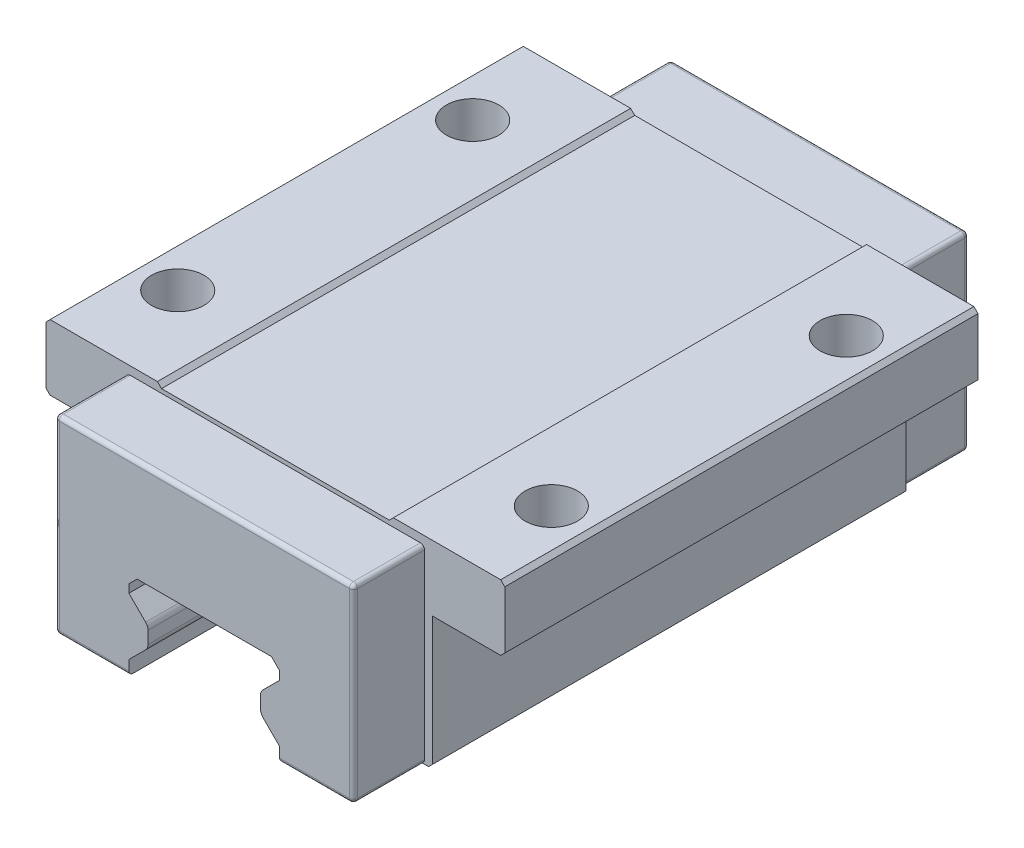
ISO-10303-21;
HEADER;
FILE_DESCRIPTION(('STEP AP214'),'2;1');
FILE_NAME('part.step','',(''),(''),'','','');
FILE_SCHEMA(('AUTOMOTIVE_DESIGN { 1 0 10303 214 1 1 1 1 }'));
ENDSEC;
DATA;
#1=APPLICATION_CONTEXT('core data for automotive mechanical design processes');
#2=APPLICATION_PROTOCOL_DEFINITION('international standard','automotive_design',2000,#1);
#3=PRODUCT_CONTEXT('',#1,'mechanical');
#4=PRODUCT('Part','Part','',(#3));
#5=PRODUCT_RELATED_PRODUCT_CATEGORY('part','',(#4));
#6=PRODUCT_DEFINITION_FORMATION('','',#4);
#7=PRODUCT_DEFINITION_CONTEXT('part definition',#1,'design');
#8=PRODUCT_DEFINITION('design','',#6,#7);
#9=PRODUCT_DEFINITION_SHAPE('','',#8);
#10=(LENGTH_UNIT() NAMED_UNIT(*) SI_UNIT(.MILLI.,.METRE.));
#11=(NAMED_UNIT(*) PLANE_ANGLE_UNIT() SI_UNIT($,.RADIAN.));
#12=(NAMED_UNIT(*) SI_UNIT($,.STERADIAN.) SOLID_ANGLE_UNIT());
#13=UNCERTAINTY_MEASURE_WITH_UNIT(LENGTH_MEASURE(1.E-05),#10,'distance_accuracy_value','');
#14=(GEOMETRIC_REPRESENTATION_CONTEXT(3) GLOBAL_UNCERTAINTY_ASSIGNED_CONTEXT((#13)) GLOBAL_UNIT_ASSIGNED_CONTEXT((#10,
#11,#12)) REPRESENTATION_CONTEXT('',''));
#15=CARTESIAN_POINT('',(0.,0.,0.));
#16=DIRECTION('',(0.,0.,1.));
#17=DIRECTION('',(1.,0.,0.));
#18=AXIS2_PLACEMENT_3D('',#15,#16,#17);
#19=CARTESIAN_POINT('',(35.,26.,16.25));
#20=DIRECTION('',(0.,1.,0.));
#21=DIRECTION('',(0.,0.,1.));
#22=AXIS2_PLACEMENT_3D('',#19,#20,#21);
#23=PLANE('',#22);
#24=CARTESIAN_POINT('',(28.5,26.,-22.5));
#25=DIRECTION('',(0.,-1.,0.));
#26=DIRECTION('',(-1.,0.,0.));
#27=AXIS2_PLACEMENT_3D('',#24,#25,#26);
#28=CIRCLE('',#27,4.);
#29=CARTESIAN_POINT('',(24.5,26.,-22.5));
#30=VERTEX_POINT('',#29);
#31=EDGE_CURVE('E1675',#30,#30,#28,.T.);
#32=ORIENTED_EDGE('',*,*,#31,.F.);
#33=EDGE_LOOP('',(#32));
#34=FACE_BOUND('',#33,.T.);
#35=DIRECTION('',(-1.,0.,0.));
#36=VECTOR('',#35,1.);
#37=CARTESIAN_POINT('',(34.375,26.,-16.25));
#38=LINE('',#37,#36);
#39=CARTESIAN_POINT('',(34.375,26.,-16.25));
#40=VERTEX_POINT('',#39);
#41=CARTESIAN_POINT('',(30.,26.,-16.25));
#42=VERTEX_POINT('',#41);
#43=EDGE_CURVE('E1638',#40,#42,#38,.T.);
#44=ORIENTED_EDGE('',*,*,#43,.T.);
#45=CARTESIAN_POINT('',(30.,26.,-22.25));
#46=DIRECTION('',(0.,1.,0.));
#47=DIRECTION('',(0.,0.,1.));
#48=AXIS2_PLACEMENT_3D('',#45,#46,#47);
#49=CIRCLE('',#48,6.);
#50=CARTESIAN_POINT('',(24.,26.,-22.25));
#51=VERTEX_POINT('',#50);
#52=EDGE_CURVE('E477',#42,#51,#49,.F.);
#53=ORIENTED_EDGE('',*,*,#52,.T.);
#54=DIRECTION('',(0.,0.,-1.));
#55=VECTOR('',#54,1.);
#56=CARTESIAN_POINT('',(24.,26.,36.1));
#57=LINE('',#56,#55);
#58=CARTESIAN_POINT('',(24.,26.,-36.1));
#59=VERTEX_POINT('',#58);
#60=EDGE_CURVE('E471',#51,#59,#57,.T.);
#61=ORIENTED_EDGE('',*,*,#60,.T.);
#62=DIRECTION('',(1.,0.,0.));
#63=VECTOR('',#62,1.);
#64=CARTESIAN_POINT('',(35.,26.,-36.1));
#65=LINE('',#64,#63);
#66=CARTESIAN_POINT('',(34.375,26.,-36.1));
#67=VERTEX_POINT('',#66);
#68=EDGE_CURVE('E475',#59,#67,#65,.T.);
#69=ORIENTED_EDGE('',*,*,#68,.T.);
#70=DIRECTION('',(0.,0.,1.));
#71=VECTOR('',#70,1.);
#72=CARTESIAN_POINT('',(34.375,26.,16.25));
#73=LINE('',#72,#71);
#74=EDGE_CURVE('E976',#67,#40,#73,.T.);
#75=ORIENTED_EDGE('',*,*,#74,.T.);
#76=EDGE_LOOP('',(#44,#53,#61,#69,#75));
#77=FACE_BOUND('',#76,.T.);
#78=ADVANCED_FACE('F39',(#34,#77),#23,.F.);
#79=CARTESIAN_POINT('',(-35.,26.,16.25));
#80=DIRECTION('',(0.,1.,0.));
#81=DIRECTION('',(0.,0.,1.));
#82=AXIS2_PLACEMENT_3D('',#79,#80,#81);
#83=PLANE('',#82);
#84=CARTESIAN_POINT('',(-28.5,26.,22.5));
#85=DIRECTION('',(0.,1.,0.));
#86=DIRECTION('',(-1.,0.,0.));
#87=AXIS2_PLACEMENT_3D('',#84,#85,#86);
#88=CIRCLE('',#87,4.);
#89=CARTESIAN_POINT('',(-32.5,26.,22.5));
#90=VERTEX_POINT('',#89);
#91=EDGE_CURVE('E495',#90,#90,#88,.T.);
#92=ORIENTED_EDGE('',*,*,#91,.T.);
#93=EDGE_LOOP('',(#92));
#94=FACE_BOUND('',#93,.T.);
#95=DIRECTION('',(1.,0.,0.));
#96=VECTOR('',#95,1.);
#97=CARTESIAN_POINT('',(-34.375,26.,16.25));
#98=LINE('',#97,#96);
#99=CARTESIAN_POINT('',(-34.375,26.,16.25));
#100=VERTEX_POINT('',#99);
#101=CARTESIAN_POINT('',(-30.,26.,16.25));
#102=VERTEX_POINT('',#101);
#103=EDGE_CURVE('E1359',#100,#102,#98,.T.);
#104=ORIENTED_EDGE('',*,*,#103,.T.);
#105=CARTESIAN_POINT('',(-30.,26.,22.25));
#106=DIRECTION('',(0.,1.,0.));
#107=DIRECTION('',(0.,0.,1.));
#108=AXIS2_PLACEMENT_3D('',#105,#106,#107);
#109=CIRCLE('',#108,6.);
#110=CARTESIAN_POINT('',(-24.,26.,22.25));
#111=VERTEX_POINT('',#110);
#112=EDGE_CURVE('E987',#102,#111,#109,.F.);
#113=ORIENTED_EDGE('',*,*,#112,.T.);
#114=DIRECTION('',(0.,0.,1.));
#115=VECTOR('',#114,1.);
#116=CARTESIAN_POINT('',(-24.,26.,36.1));
#117=LINE('',#116,#115);
#118=CARTESIAN_POINT('',(-24.,26.,36.1));
#119=VERTEX_POINT('',#118);
#120=EDGE_CURVE('E1362',#111,#119,#117,.T.);
#121=ORIENTED_EDGE('',*,*,#120,.T.);
#122=DIRECTION('',(1.,0.,0.));
#123=VECTOR('',#122,1.);
#124=CARTESIAN_POINT('',(-35.,26.,36.1));
#125=LINE('',#124,#123);
#126=CARTESIAN_POINT('',(-34.375,26.,36.1));
#127=VERTEX_POINT('',#126);
#128=EDGE_CURVE('E1344',#127,#119,#125,.T.);
#129=ORIENTED_EDGE('',*,*,#128,.F.);
#130=DIRECTION('',(0.,0.,-1.));
#131=VECTOR('',#130,1.);
#132=CARTESIAN_POINT('',(-34.375,26.,16.25));
#133=LINE('',#132,#131);
#134=EDGE_CURVE('E929',#127,#100,#133,.T.);
#135=ORIENTED_EDGE('',*,*,#134,.T.);
#136=EDGE_LOOP('',(#104,#113,#121,#129,#135));
#137=FACE_BOUND('',#136,.T.);
#138=ADVANCED_FACE('F1051',(#94,#137),#83,.F.);
#139=CARTESIAN_POINT('',(24.,5.8,36.1));
#140=DIRECTION('',(-1.,0.,0.));
#141=DIRECTION('',(0.,0.,1.));
#142=AXIS2_PLACEMENT_3D('',#139,#140,#141);
#143=PLANE('',#142);
#144=ORIENTED_EDGE('',*,*,#60,.F.);
#145=DIRECTION('',(0.,1.,0.));
#146=VECTOR('',#145,1.);
#147=CARTESIAN_POINT('',(24.,15.625,-22.25));
#148=LINE('',#147,#146);
#149=CARTESIAN_POINT('',(24.,15.625,-22.25));
#150=VERTEX_POINT('',#149);
#151=EDGE_CURVE('E1013',#51,#150,#148,.F.);
#152=ORIENTED_EDGE('',*,*,#151,.T.);
#153=DIRECTION('',(0.,0.,-1.));
#154=VECTOR('',#153,1.);
#155=CARTESIAN_POINT('',(24.,15.625,16.25));
#156=LINE('',#155,#154);
#157=CARTESIAN_POINT('',(24.,15.625,22.25));
#158=VERTEX_POINT('',#157);
#159=EDGE_CURVE('E1369',#158,#150,#156,.T.);
#160=ORIENTED_EDGE('',*,*,#159,.F.);
#161=DIRECTION('',(0.,1.,0.));
#162=VECTOR('',#161,1.);
#163=CARTESIAN_POINT('',(24.,5.8,22.25));
#164=LINE('',#163,#162);
#165=CARTESIAN_POINT('',(24.,26.,22.25));
#166=VERTEX_POINT('',#165);
#167=EDGE_CURVE('E1009',#158,#166,#164,.T.);
#168=ORIENTED_EDGE('',*,*,#167,.T.);
#169=CARTESIAN_POINT('',(24.,26.,36.1));
#170=VERTEX_POINT('',#169);
#171=EDGE_CURVE('E483',#170,#166,#57,.T.);
#172=ORIENTED_EDGE('',*,*,#171,.F.);
#173=DIRECTION('',(0.,1.,0.));
#174=VECTOR('',#173,1.);
#175=CARTESIAN_POINT('',(24.,5.8,36.1));
#176=LINE('',#175,#174);
#177=CARTESIAN_POINT('',(24.,6.42500000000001,36.1));
#178=VERTEX_POINT('',#177);
#179=EDGE_CURVE('E527',#178,#170,#176,.T.);
#180=ORIENTED_EDGE('',*,*,#179,.F.);
#181=DIRECTION('',(0.,0.,-1.));
#182=VECTOR('',#181,1.);
#183=CARTESIAN_POINT('',(24.,6.42500000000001,36.1));
#184=LINE('',#183,#182);
#185=CARTESIAN_POINT('',(24.,6.42500000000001,-36.1));
#186=VERTEX_POINT('',#185);
#187=EDGE_CURVE('E501',#178,#186,#184,.T.);
#188=ORIENTED_EDGE('',*,*,#187,.T.);
#189=DIRECTION('',(0.,1.,0.));
#190=VECTOR('',#189,1.);
#191=CARTESIAN_POINT('',(24.,5.8,-36.1));
#192=LINE('',#191,#190);
#193=EDGE_CURVE('E490',#186,#59,#192,.T.);
#194=ORIENTED_EDGE('',*,*,#193,.T.);
#195=EDGE_LOOP('',(#144,#152,#160,#168,#172,#180,#188,#194));
#196=FACE_BOUND('',#195,.T.);
#197=ADVANCED_FACE('F498',(#196),#143,.F.);
#198=CARTESIAN_POINT('',(34.375,15.625,16.25));
#199=DIRECTION('',(0.,0.,1.));
#200=DIRECTION('',(1.,0.,0.));
#201=AXIS2_PLACEMENT_3D('',#198,#199,#200);
#202=PLANE('',#201);
#203=DIRECTION('',(-1.,0.,0.));
#204=VECTOR('',#203,1.);
#205=CARTESIAN_POINT('',(34.375,26.,16.25));
#206=LINE('',#205,#204);
#207=CARTESIAN_POINT('',(34.375,26.,16.25));
#208=VERTEX_POINT('',#207);
#209=CARTESIAN_POINT('',(30.,26.,16.25));
#210=VERTEX_POINT('',#209);
#211=EDGE_CURVE('E484',#208,#210,#206,.T.);
#212=ORIENTED_EDGE('',*,*,#211,.T.);
#213=DIRECTION('',(0.,1.,0.));
#214=VECTOR('',#213,1.);
#215=CARTESIAN_POINT('',(30.,15.625,16.25));
#216=LINE('',#215,#214);
#217=CARTESIAN_POINT('',(30.,25.0324438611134,16.25));
#218=VERTEX_POINT('',#217);
#219=EDGE_CURVE('E60',#210,#218,#216,.F.);
#220=ORIENTED_EDGE('',*,*,#219,.T.);
#221=CARTESIAN_POINT('',(34.375,15.625,16.25));
#222=DIRECTION('',(0.,0.,-1.));
#223=DIRECTION('',(1.,0.,0.));
#224=AXIS2_PLACEMENT_3D('',#221,#222,#223);
#225=CIRCLE('',#224,10.375);
#226=EDGE_CURVE('E1366',#218,#208,#225,.T.);
#227=ORIENTED_EDGE('',*,*,#226,.T.);
#228=EDGE_LOOP('',(#212,#220,#227));
#229=FACE_BOUND('',#228,.T.);
#230=ADVANCED_FACE('F1148',(#229),#202,.T.);
#231=CARTESIAN_POINT('',(34.375,15.625,-16.25));
#232=DIRECTION('',(0.,0.,1.));
#233=DIRECTION('',(1.,0.,0.));
#234=AXIS2_PLACEMENT_3D('',#231,#232,#233);
#235=PLANE('',#234);
#236=CARTESIAN_POINT('',(34.375,15.625,-16.25));
#237=DIRECTION('',(0.,0.,-1.));
#238=DIRECTION('',(1.,0.,0.));
#239=AXIS2_PLACEMENT_3D('',#236,#237,#238);
#240=CIRCLE('',#239,10.375);
#241=CARTESIAN_POINT('',(30.,25.0324438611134,-16.25));
#242=VERTEX_POINT('',#241);
#243=EDGE_CURVE('E1370',#242,#40,#240,.T.);
#244=ORIENTED_EDGE('',*,*,#243,.F.);
#245=DIRECTION('',(0.,1.,0.));
#246=VECTOR('',#245,1.);
#247=CARTESIAN_POINT('',(30.,26.,-16.25));
#248=LINE('',#247,#246);
#249=EDGE_CURVE('E1003',#242,#42,#248,.T.);
#250=ORIENTED_EDGE('',*,*,#249,.T.);
#251=ORIENTED_EDGE('',*,*,#43,.F.);
#252=EDGE_LOOP('',(#244,#250,#251));
#253=FACE_BOUND('',#252,.T.);
#254=ADVANCED_FACE('F1140',(#253),#235,.F.);
#255=CARTESIAN_POINT('',(-24.,5.8,36.1));
#256=DIRECTION('',(1.,0.,0.));
#257=DIRECTION('',(0.,0.,-1.));
#258=AXIS2_PLACEMENT_3D('',#255,#256,#257);
#259=PLANE('',#258);
#260=ORIENTED_EDGE('',*,*,#120,.F.);
#261=DIRECTION('',(0.,1.,0.));
#262=VECTOR('',#261,1.);
#263=CARTESIAN_POINT('',(-24.,15.625,22.25));
#264=LINE('',#263,#262);
#265=CARTESIAN_POINT('',(-24.,15.625,22.25));
#266=VERTEX_POINT('',#265);
#267=EDGE_CURVE('E994',#111,#266,#264,.F.);
#268=ORIENTED_EDGE('',*,*,#267,.T.);
#269=DIRECTION('',(0.,0.,-1.));
#270=VECTOR('',#269,1.);
#271=CARTESIAN_POINT('',(-24.,15.625,16.25));
#272=LINE('',#271,#270);
#273=CARTESIAN_POINT('',(-24.,15.625,-22.25));
#274=VERTEX_POINT('',#273);
#275=EDGE_CURVE('E1384',#266,#274,#272,.T.);
#276=ORIENTED_EDGE('',*,*,#275,.T.);
#277=DIRECTION('',(0.,1.,0.));
#278=VECTOR('',#277,1.);
#279=CARTESIAN_POINT('',(-24.,5.8,-22.25));
#280=LINE('',#279,#278);
#281=CARTESIAN_POINT('',(-24.,26.,-22.25));
#282=VERTEX_POINT('',#281);
#283=EDGE_CURVE('E990',#274,#282,#280,.T.);
#284=ORIENTED_EDGE('',*,*,#283,.T.);
#285=CARTESIAN_POINT('',(-24.,26.,-36.1));
#286=VERTEX_POINT('',#285);
#287=EDGE_CURVE('E1365',#286,#282,#117,.T.);
#288=ORIENTED_EDGE('',*,*,#287,.F.);
#289=DIRECTION('',(0.,-1.,0.));
#290=VECTOR('',#289,1.);
#291=CARTESIAN_POINT('',(-24.,5.8,-36.1));
#292=LINE('',#291,#290);
#293=CARTESIAN_POINT('',(-24.,6.425,-36.1));
#294=VERTEX_POINT('',#293);
#295=EDGE_CURVE('E520',#286,#294,#292,.T.);
#296=ORIENTED_EDGE('',*,*,#295,.T.);
#297=DIRECTION('',(0.,0.,1.));
#298=VECTOR('',#297,1.);
#299=CARTESIAN_POINT('',(-24.,6.425,36.1));
#300=LINE('',#299,#298);
#301=CARTESIAN_POINT('',(-24.,6.425,36.1));
#302=VERTEX_POINT('',#301);
#303=EDGE_CURVE('E654',#294,#302,#300,.T.);
#304=ORIENTED_EDGE('',*,*,#303,.T.);
#305=DIRECTION('',(0.,-1.,0.));
#306=VECTOR('',#305,1.);
#307=CARTESIAN_POINT('',(-24.,5.8,36.1));
#308=LINE('',#307,#306);
#309=EDGE_CURVE('E1499',#119,#302,#308,.T.);
#310=ORIENTED_EDGE('',*,*,#309,.F.);
#311=EDGE_LOOP('',(#260,#268,#276,#284,#288,#296,#304,#310));
#312=FACE_BOUND('',#311,.T.);
#313=ADVANCED_FACE('F1136',(#312),#259,.F.);
#314=CARTESIAN_POINT('',(-34.375,15.625,16.25));
#315=DIRECTION('',(0.,0.,-1.));
#316=DIRECTION('',(-1.,0.,0.));
#317=AXIS2_PLACEMENT_3D('',#314,#315,#316);
#318=PLANE('',#317);
#319=CARTESIAN_POINT('',(-34.375,15.625,16.25));
#320=DIRECTION('',(0.,0.,-1.));
#321=DIRECTION('',(-1.,0.,0.));
#322=AXIS2_PLACEMENT_3D('',#319,#320,#321);
#323=CIRCLE('',#322,10.375);
#324=CARTESIAN_POINT('',(-30.,25.0324438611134,16.25));
#325=VERTEX_POINT('',#324);
#326=EDGE_CURVE('E1380',#100,#325,#323,.T.);
#327=ORIENTED_EDGE('',*,*,#326,.T.);
#328=DIRECTION('',(0.,1.,0.));
#329=VECTOR('',#328,1.);
#330=CARTESIAN_POINT('',(-30.,26.,16.25));
#331=LINE('',#330,#329);
#332=EDGE_CURVE('E983',#325,#102,#331,.T.);
#333=ORIENTED_EDGE('',*,*,#332,.T.);
#334=ORIENTED_EDGE('',*,*,#103,.F.);
#335=EDGE_LOOP('',(#327,#333,#334));
#336=FACE_BOUND('',#335,.T.);
#337=ADVANCED_FACE('F1139',(#336),#318,.F.);
#338=CARTESIAN_POINT('',(-34.375,15.625,-16.25));
#339=DIRECTION('',(0.,0.,-1.));
#340=DIRECTION('',(-1.,0.,0.));
#341=AXIS2_PLACEMENT_3D('',#338,#339,#340);
#342=PLANE('',#341);
#343=DIRECTION('',(1.,0.,0.));
#344=VECTOR('',#343,1.);
#345=CARTESIAN_POINT('',(-34.375,26.,-16.25));
#346=LINE('',#345,#344);
#347=CARTESIAN_POINT('',(-34.375,26.,-16.25));
#348=VERTEX_POINT('',#347);
#349=CARTESIAN_POINT('',(-30.,26.,-16.25));
#350=VERTEX_POINT('',#349);
#351=EDGE_CURVE('E1351',#348,#350,#346,.T.);
#352=ORIENTED_EDGE('',*,*,#351,.T.);
#353=DIRECTION('',(0.,1.,0.));
#354=VECTOR('',#353,1.);
#355=CARTESIAN_POINT('',(-30.,15.625,-16.25));
#356=LINE('',#355,#354);
#357=CARTESIAN_POINT('',(-30.,25.0324438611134,-16.25));
#358=VERTEX_POINT('',#357);
#359=EDGE_CURVE('E1001',#350,#358,#356,.F.);
#360=ORIENTED_EDGE('',*,*,#359,.T.);
#361=CARTESIAN_POINT('',(-34.375,15.625,-16.25));
#362=DIRECTION('',(0.,0.,-1.));
#363=DIRECTION('',(-1.,0.,0.));
#364=AXIS2_PLACEMENT_3D('',#361,#362,#363);
#365=CIRCLE('',#364,10.375);
#366=EDGE_CURVE('E1379',#348,#358,#365,.T.);
#367=ORIENTED_EDGE('',*,*,#366,.F.);
#368=EDGE_LOOP('',(#352,#360,#367));
#369=FACE_BOUND('',#368,.T.);
#370=ADVANCED_FACE('F1044',(#369),#342,.T.);
#371=CARTESIAN_POINT('',(-24.,36.,36.1));
#372=DIRECTION('',(0.,-1.,0.));
#373=DIRECTION('',(1.,0.,0.));
#374=AXIS2_PLACEMENT_3D('',#371,#372,#373);
#375=PLANE('',#374);
#376=CARTESIAN_POINT('',(-28.5,36.,-22.5));
#377=DIRECTION('',(0.,-1.,0.));
#378=DIRECTION('',(-1.,0.,0.));
#379=AXIS2_PLACEMENT_3D('',#376,#377,#378);
#380=CIRCLE('',#379,4.);
#381=CARTESIAN_POINT('',(-32.5,36.,-22.5));
#382=VERTEX_POINT('',#381);
#383=EDGE_CURVE('E1746',#382,#382,#380,.T.);
#384=ORIENTED_EDGE('',*,*,#383,.T.);
#385=EDGE_LOOP('',(#384));
#386=FACE_BOUND('',#385,.T.);
#387=CARTESIAN_POINT('',(-28.5,36.,22.5));
#388=DIRECTION('',(0.,1.,0.));
#389=DIRECTION('',(-1.,0.,0.));
#390=AXIS2_PLACEMENT_3D('',#387,#388,#389);
#391=CIRCLE('',#390,4.);
#392=CARTESIAN_POINT('',(-32.5,36.,22.5));
#393=VERTEX_POINT('',#392);
#394=EDGE_CURVE('E1663',#393,#393,#391,.T.);
#395=ORIENTED_EDGE('',*,*,#394,.F.);
#396=EDGE_LOOP('',(#395));
#397=FACE_BOUND('',#396,.T.);
#398=DIRECTION('',(-1.,0.,0.));
#399=VECTOR('',#398,1.);
#400=CARTESIAN_POINT('',(-24.,36.,-36.1));
#401=LINE('',#400,#399);
#402=CARTESIAN_POINT('',(-18.,36.,-36.1));
#403=VERTEX_POINT('',#402);
#404=CARTESIAN_POINT('',(-34.375,36.,-36.1));
#405=VERTEX_POINT('',#404);
#406=EDGE_CURVE('E503',#403,#405,#401,.T.);
#407=ORIENTED_EDGE('',*,*,#406,.T.);
#408=DIRECTION('',(0.,0.,1.));
#409=VECTOR('',#408,1.);
#410=CARTESIAN_POINT('',(-34.375,36.,36.1));
#411=LINE('',#410,#409);
#412=CARTESIAN_POINT('',(-34.375,36.,36.1));
#413=VERTEX_POINT('',#412);
#414=EDGE_CURVE('E963',#405,#413,#411,.T.);
#415=ORIENTED_EDGE('',*,*,#414,.T.);
#416=DIRECTION('',(-1.,0.,0.));
#417=VECTOR('',#416,1.);
#418=CARTESIAN_POINT('',(-24.,36.,36.1));
#419=LINE('',#418,#417);
#420=CARTESIAN_POINT('',(-18.,36.,36.1));
#421=VERTEX_POINT('',#420);
#422=EDGE_CURVE('E1496',#421,#413,#419,.T.);
#423=ORIENTED_EDGE('',*,*,#422,.F.);
#424=DIRECTION('',(0.,0.,-1.));
#425=VECTOR('',#424,1.);
#426=CARTESIAN_POINT('',(-18.,36.,36.1));
#427=LINE('',#426,#425);
#428=EDGE_CURVE('E625',#421,#403,#427,.T.);
#429=ORIENTED_EDGE('',*,*,#428,.T.);
#430=EDGE_LOOP('',(#407,#415,#423,#429));
#431=FACE_BOUND('',#430,.T.);
#432=ADVANCED_FACE('F1145',(#386,#397,#431),#375,.F.);
#433=CARTESIAN_POINT('',(11.5,19.2,-46.95));
#434=DIRECTION('',(1.,0.,0.));
#435=DIRECTION('',(0.,1.,0.));
#436=AXIS2_PLACEMENT_3D('',#433,#434,#435);
#437=PLANE('',#436);
#438=DIRECTION('',(0.,-1.,0.));
#439=VECTOR('',#438,1.);
#440=CARTESIAN_POINT('',(11.5,0.,46.95));
#441=LINE('',#440,#439);
#442=CARTESIAN_POINT('',(11.5,17.95,46.95));
#443=VERTEX_POINT('',#442);
#444=CARTESIAN_POINT('',(11.5,16.7,46.95));
#445=VERTEX_POINT('',#444);
#446=EDGE_CURVE('E540',#443,#445,#441,.T.);
#447=ORIENTED_EDGE('',*,*,#446,.F.);
#448=DIRECTION('',(0.,0.,-1.));
#449=VECTOR('',#448,1.);
#450=CARTESIAN_POINT('',(11.5,17.95,-46.95));
#451=LINE('',#450,#449);
#452=CARTESIAN_POINT('',(11.5,17.95,-46.95));
#453=VERTEX_POINT('',#452);
#454=EDGE_CURVE('E550',#443,#453,#451,.T.);
#455=ORIENTED_EDGE('',*,*,#454,.T.);
#456=DIRECTION('',(0.,1.,0.));
#457=VECTOR('',#456,1.);
#458=CARTESIAN_POINT('',(11.5,19.2,-46.95));
#459=LINE('',#458,#457);
#460=CARTESIAN_POINT('',(11.5,16.7,-46.95));
#461=VERTEX_POINT('',#460);
#462=EDGE_CURVE('E1462',#461,#453,#459,.T.);
#463=ORIENTED_EDGE('',*,*,#462,.F.);
#464=DIRECTION('',(0.,0.,1.));
#465=VECTOR('',#464,1.);
#466=CARTESIAN_POINT('',(11.5,16.7,-56.1733098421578));
#467=LINE('',#466,#465);
#468=EDGE_CURVE('E1401',#461,#445,#467,.T.);
#469=ORIENTED_EDGE('',*,*,#468,.T.);
#470=EDGE_LOOP('',(#447,#455,#463,#469));
#471=FACE_BOUND('',#470,.T.);
#472=ADVANCED_FACE('F1101',(#471),#437,.F.);
#473=CARTESIAN_POINT('',(-11.5,19.2,-46.95));
#474=DIRECTION('',(-1.,0.,0.));
#475=DIRECTION('',(0.,-1.,0.));
#476=AXIS2_PLACEMENT_3D('',#473,#474,#475);
#477=PLANE('',#476);
#478=DIRECTION('',(0.,-1.,0.));
#479=VECTOR('',#478,1.);
#480=CARTESIAN_POINT('',(-11.5,19.2,46.95));
#481=LINE('',#480,#479);
#482=CARTESIAN_POINT('',(-11.5,7.95,46.95));
#483=VERTEX_POINT('',#482);
#484=CARTESIAN_POINT('',(-11.5,6.425,46.95));
#485=VERTEX_POINT('',#484);
#486=EDGE_CURVE('E1475',#483,#485,#481,.T.);
#487=ORIENTED_EDGE('',*,*,#486,.T.);
#488=CARTESIAN_POINT('',(-11.5,6.425,46.325));
#489=DIRECTION('',(-1.,0.,0.));
#490=DIRECTION('',(0.,-1.,0.));
#491=AXIS2_PLACEMENT_3D('',#488,#489,#490);
#492=CIRCLE('',#491,0.625);
#493=CARTESIAN_POINT('',(-11.5,5.8,46.325));
#494=VERTEX_POINT('',#493);
#495=EDGE_CURVE('E763',#485,#494,#492,.F.);
#496=ORIENTED_EDGE('',*,*,#495,.T.);
#497=DIRECTION('',(0.,0.,1.));
#498=VECTOR('',#497,1.);
#499=CARTESIAN_POINT('',(-11.5,5.8,36.1));
#500=LINE('',#499,#498);
#501=CARTESIAN_POINT('',(-11.5,5.8,-46.325));
#502=VERTEX_POINT('',#501);
#503=EDGE_CURVE('E1471',#502,#494,#500,.T.);
#504=ORIENTED_EDGE('',*,*,#503,.F.);
#505=CARTESIAN_POINT('',(-11.5,6.425,-46.325));
#506=DIRECTION('',(-1.,0.,0.));
#507=DIRECTION('',(0.,-1.,0.));
#508=AXIS2_PLACEMENT_3D('',#505,#506,#507);
#509=CIRCLE('',#508,0.625);
#510=CARTESIAN_POINT('',(-11.5,6.425,-46.95));
#511=VERTEX_POINT('',#510);
#512=EDGE_CURVE('E760',#502,#511,#509,.F.);
#513=ORIENTED_EDGE('',*,*,#512,.T.);
#514=DIRECTION('',(0.,-1.,0.));
#515=VECTOR('',#514,1.);
#516=CARTESIAN_POINT('',(-11.5,19.2,-46.95));
#517=LINE('',#516,#515);
#518=CARTESIAN_POINT('',(-11.5,7.95,-46.95));
#519=VERTEX_POINT('',#518);
#520=EDGE_CURVE('E1466',#519,#511,#517,.T.);
#521=ORIENTED_EDGE('',*,*,#520,.F.);
#522=DIRECTION('',(0.,0.,1.));
#523=VECTOR('',#522,1.);
#524=CARTESIAN_POINT('',(-11.5,7.95,-56.1733098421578));
#525=LINE('',#524,#523);
#526=EDGE_CURVE('E1432',#519,#483,#525,.T.);
#527=ORIENTED_EDGE('',*,*,#526,.T.);
#528=EDGE_LOOP('',(#487,#496,#504,#513,#521,#527));
#529=FACE_BOUND('',#528,.T.);
#530=ADVANCED_FACE('F1093',(#529),#477,.F.);
#531=CARTESIAN_POINT('',(-24.,5.8,36.1));
#532=DIRECTION('',(0.,1.,0.));
#533=DIRECTION('',(-1.,0.,0.));
#534=AXIS2_PLACEMENT_3D('',#531,#532,#533);
#535=PLANE('',#534);
#536=DIRECTION('',(0.,0.,-1.));
#537=VECTOR('',#536,1.);
#538=CARTESIAN_POINT('',(22.125,5.8,36.1));
#539=LINE('',#538,#537);
#540=CARTESIAN_POINT('',(22.125,5.8,36.1));
#541=VERTEX_POINT('',#540);
#542=CARTESIAN_POINT('',(22.125,5.8,46.325));
#543=VERTEX_POINT('',#542);
#544=EDGE_CURVE('E709',#541,#543,#539,.F.);
#545=ORIENTED_EDGE('',*,*,#544,.T.);
#546=DIRECTION('',(1.,0.,0.));
#547=VECTOR('',#546,1.);
#548=CARTESIAN_POINT('',(-24.,5.8,46.325));
#549=LINE('',#548,#547);
#550=CARTESIAN_POINT('',(11.5,5.8,46.325));
#551=VERTEX_POINT('',#550);
#552=EDGE_CURVE('E712',#543,#551,#549,.F.);
#553=ORIENTED_EDGE('',*,*,#552,.T.);
#554=DIRECTION('',(0.,0.,-1.));
#555=VECTOR('',#554,1.);
#556=CARTESIAN_POINT('',(11.5,5.8,36.1));
#557=LINE('',#556,#555);
#558=CARTESIAN_POINT('',(11.5,5.8,-46.325));
#559=VERTEX_POINT('',#558);
#560=EDGE_CURVE('E1483',#551,#559,#557,.T.);
#561=ORIENTED_EDGE('',*,*,#560,.T.);
#562=DIRECTION('',(1.,0.,0.));
#563=VECTOR('',#562,1.);
#564=CARTESIAN_POINT('',(22.75,5.8,-46.325));
#565=LINE('',#564,#563);
#566=CARTESIAN_POINT('',(22.125,5.8,-46.325));
#567=VERTEX_POINT('',#566);
#568=EDGE_CURVE('E706',#559,#567,#565,.T.);
#569=ORIENTED_EDGE('',*,*,#568,.T.);
#570=DIRECTION('',(0.,0.,-1.));
#571=VECTOR('',#570,1.);
#572=CARTESIAN_POINT('',(22.125,5.8,36.1));
#573=LINE('',#572,#571);
#574=CARTESIAN_POINT('',(22.125,5.8,-36.1));
#575=VERTEX_POINT('',#574);
#576=EDGE_CURVE('E702',#567,#575,#573,.F.);
#577=ORIENTED_EDGE('',*,*,#576,.T.);
#578=DIRECTION('',(1.,0.,0.));
#579=VECTOR('',#578,1.);
#580=CARTESIAN_POINT('',(-24.,5.8,-36.1));
#581=LINE('',#580,#579);
#582=CARTESIAN_POINT('',(23.375,5.8,-36.1));
#583=VERTEX_POINT('',#582);
#584=EDGE_CURVE('E523',#575,#583,#581,.T.);
#585=ORIENTED_EDGE('',*,*,#584,.T.);
#586=DIRECTION('',(0.,0.,1.));
#587=VECTOR('',#586,1.);
#588=CARTESIAN_POINT('',(23.375,5.8,36.1));
#589=LINE('',#588,#587);
#590=CARTESIAN_POINT('',(23.375,5.8,36.1));
#591=VERTEX_POINT('',#590);
#592=EDGE_CURVE('E647',#583,#591,#589,.T.);
#593=ORIENTED_EDGE('',*,*,#592,.T.);
#594=DIRECTION('',(1.,0.,0.));
#595=VECTOR('',#594,1.);
#596=CARTESIAN_POINT('',(-24.,5.8,36.1));
#597=LINE('',#596,#595);
#598=EDGE_CURVE('E1501',#541,#591,#597,.T.);
#599=ORIENTED_EDGE('',*,*,#598,.F.);
#600=EDGE_LOOP('',(#545,#553,#561,#569,#577,#585,#593,#599));
#601=FACE_BOUND('',#600,.T.);
#602=ADVANCED_FACE('F1128',(#601),#535,.F.);
#603=CARTESIAN_POINT('',(0.,0.,36.1));
#604=DIRECTION('',(0.,0.,-1.));
#605=DIRECTION('',(-1.,0.,0.));
#606=AXIS2_PLACEMENT_3D('',#603,#604,#605);
#607=PLANE('',#606);
#608=DIRECTION('',(0.,-1.,0.));
#609=VECTOR('',#608,1.);
#610=CARTESIAN_POINT('',(-35.,26.,36.1));
#611=LINE('',#610,#609);
#612=CARTESIAN_POINT('',(-35.,35.375,36.1));
#613=VERTEX_POINT('',#612);
#614=CARTESIAN_POINT('',(-35.,26.625,36.1));
#615=VERTEX_POINT('',#614);
#616=EDGE_CURVE('E1348',#613,#615,#611,.T.);
#617=ORIENTED_EDGE('',*,*,#616,.T.);
#618=DIRECTION('',(-0.707106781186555,0.70710678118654,0.));
#619=VECTOR('',#618,1.);
#620=CARTESIAN_POINT('',(-34.375,26.,36.1));
#621=LINE('',#620,#619);
#622=EDGE_CURVE('E960',#615,#127,#621,.F.);
#623=ORIENTED_EDGE('',*,*,#622,.T.);
#624=ORIENTED_EDGE('',*,*,#128,.T.);
#625=ORIENTED_EDGE('',*,*,#309,.T.);
#626=DIRECTION('',(-0.707106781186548,0.707106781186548,0.));
#627=VECTOR('',#626,1.);
#628=CARTESIAN_POINT('',(-23.375,5.8,36.1));
#629=LINE('',#628,#627);
#630=CARTESIAN_POINT('',(-23.375,5.8,36.1));
#631=VERTEX_POINT('',#630);
#632=EDGE_CURVE('E641',#302,#631,#629,.F.);
#633=ORIENTED_EDGE('',*,*,#632,.T.);
#634=CARTESIAN_POINT('',(-22.125,5.8,36.1));
#635=VERTEX_POINT('',#634);
#636=EDGE_CURVE('E516',#631,#635,#597,.T.);
#637=ORIENTED_EDGE('',*,*,#636,.T.);
#638=CARTESIAN_POINT('',(-22.125,6.425,36.1));
#639=DIRECTION('',(0.,0.,-1.));
#640=DIRECTION('',(-1.,0.,0.));
#641=AXIS2_PLACEMENT_3D('',#638,#639,#640);
#642=CIRCLE('',#641,0.625);
#643=CARTESIAN_POINT('',(-22.75,6.425,36.1));
#644=VERTEX_POINT('',#643);
#645=EDGE_CURVE('E806',#635,#644,#642,.T.);
#646=ORIENTED_EDGE('',*,*,#645,.T.);
#647=DIRECTION('',(0.,-1.,0.));
#648=VECTOR('',#647,1.);
#649=CARTESIAN_POINT('',(-22.75,0.,36.1));
#650=LINE('',#649,#648);
#651=CARTESIAN_POINT('',(-22.75,34.125,36.1));
#652=VERTEX_POINT('',#651);
#653=EDGE_CURVE('E504',#652,#644,#650,.T.);
#654=ORIENTED_EDGE('',*,*,#653,.F.);
#655=CARTESIAN_POINT('',(-22.125,34.125,36.1));
#656=DIRECTION('',(0.,0.,-1.));
#657=DIRECTION('',(-1.,0.,0.));
#658=AXIS2_PLACEMENT_3D('',#655,#656,#657);
#659=CIRCLE('',#658,0.625);
#660=CARTESIAN_POINT('',(-22.125,34.75,36.1));
#661=VERTEX_POINT('',#660);
#662=EDGE_CURVE('E814',#652,#661,#659,.T.);
#663=ORIENTED_EDGE('',*,*,#662,.T.);
#664=DIRECTION('',(-1.,0.,0.));
#665=VECTOR('',#664,1.);
#666=CARTESIAN_POINT('',(0.,34.75,36.1));
#667=LINE('',#666,#665);
#668=CARTESIAN_POINT('',(22.125,34.75,36.1));
#669=VERTEX_POINT('',#668);
#670=EDGE_CURVE('E1487',#669,#661,#667,.T.);
#671=ORIENTED_EDGE('',*,*,#670,.F.);
#672=CARTESIAN_POINT('',(22.125,34.125,36.1));
#673=DIRECTION('',(0.,0.,-1.));
#674=DIRECTION('',(-1.,0.,0.));
#675=AXIS2_PLACEMENT_3D('',#672,#673,#674);
#676=CIRCLE('',#675,0.625);
#677=CARTESIAN_POINT('',(22.75,34.125,36.1));
#678=VERTEX_POINT('',#677);
#679=EDGE_CURVE('E817',#669,#678,#676,.T.);
#680=ORIENTED_EDGE('',*,*,#679,.T.);
#681=DIRECTION('',(0.,1.,0.));
#682=VECTOR('',#681,1.);
#683=CARTESIAN_POINT('',(22.75,0.,36.1));
#684=LINE('',#683,#682);
#685=CARTESIAN_POINT('',(22.75,6.425,36.1));
#686=VERTEX_POINT('',#685);
#687=EDGE_CURVE('E513',#686,#678,#684,.T.);
#688=ORIENTED_EDGE('',*,*,#687,.F.);
#689=CARTESIAN_POINT('',(22.125,6.425,36.1));
#690=DIRECTION('',(0.,0.,-1.));
#691=DIRECTION('',(-1.,0.,0.));
#692=AXIS2_PLACEMENT_3D('',#689,#690,#691);
#693=CIRCLE('',#692,0.625);
#694=EDGE_CURVE('E810',#686,#541,#693,.T.);
#695=ORIENTED_EDGE('',*,*,#694,.T.);
#696=ORIENTED_EDGE('',*,*,#598,.T.);
#697=DIRECTION('',(-0.707106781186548,-0.707106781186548,0.));
#698=VECTOR('',#697,1.);
#699=CARTESIAN_POINT('',(24.,6.42500000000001,36.1));
#700=LINE('',#699,#698);
#701=EDGE_CURVE('E644',#591,#178,#700,.F.);
#702=ORIENTED_EDGE('',*,*,#701,.T.);
#703=ORIENTED_EDGE('',*,*,#179,.T.);
#704=DIRECTION('',(1.,0.,0.));
#705=VECTOR('',#704,1.);
#706=CARTESIAN_POINT('',(35.,26.,36.1));
#707=LINE('',#706,#705);
#708=CARTESIAN_POINT('',(34.375,26.,36.1));
#709=VERTEX_POINT('',#708);
#710=EDGE_CURVE('E1333',#170,#709,#707,.T.);
#711=ORIENTED_EDGE('',*,*,#710,.T.);
#712=DIRECTION('',(-0.707106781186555,-0.70710678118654,0.));
#713=VECTOR('',#712,1.);
#714=CARTESIAN_POINT('',(35.,26.625,36.1));
#715=LINE('',#714,#713);
#716=CARTESIAN_POINT('',(35.,26.625,36.1));
#717=VERTEX_POINT('',#716);
#718=EDGE_CURVE('E954',#709,#717,#715,.F.);
#719=ORIENTED_EDGE('',*,*,#718,.T.);
#720=DIRECTION('',(0.,1.,0.));
#721=VECTOR('',#720,1.);
#722=CARTESIAN_POINT('',(35.,26.,36.1));
#723=LINE('',#722,#721);
#724=CARTESIAN_POINT('',(35.,35.375,36.1));
#725=VERTEX_POINT('',#724);
#726=EDGE_CURVE('E1634',#717,#725,#723,.T.);
#727=ORIENTED_EDGE('',*,*,#726,.T.);
#728=DIRECTION('',(0.70710678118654,-0.707106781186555,0.));
#729=VECTOR('',#728,1.);
#730=CARTESIAN_POINT('',(34.375,36.,36.1));
#731=LINE('',#730,#729);
#732=CARTESIAN_POINT('',(34.375,36.,36.1));
#733=VERTEX_POINT('',#732);
#734=EDGE_CURVE('E951',#725,#733,#731,.F.);
#735=ORIENTED_EDGE('',*,*,#734,.T.);
#736=CARTESIAN_POINT('',(18.,36.,36.1));
#737=VERTEX_POINT('',#736);
#738=EDGE_CURVE('E1497',#733,#737,#419,.T.);
#739=ORIENTED_EDGE('',*,*,#738,.T.);
#740=DIRECTION('',(0.707106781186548,0.707106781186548,0.));
#741=VECTOR('',#740,1.);
#742=CARTESIAN_POINT('',(-9.,9.,36.1));
#743=LINE('',#742,#741);
#744=CARTESIAN_POINT('',(17.375,35.375,36.1));
#745=VERTEX_POINT('',#744);
#746=EDGE_CURVE('E665',#737,#745,#743,.F.);
#747=ORIENTED_EDGE('',*,*,#746,.T.);
#748=DIRECTION('',(1.,0.,0.));
#749=VECTOR('',#748,1.);
#750=CARTESIAN_POINT('',(-18.,35.375,36.1));
#751=LINE('',#750,#749);
#752=CARTESIAN_POINT('',(-17.375,35.375,36.1));
#753=VERTEX_POINT('',#752);
#754=EDGE_CURVE('E878',#753,#745,#751,.T.);
#755=ORIENTED_EDGE('',*,*,#754,.F.);
#756=DIRECTION('',(0.707106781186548,-0.707106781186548,0.));
#757=VECTOR('',#756,1.);
#758=CARTESIAN_POINT('',(9.,9.,36.1));
#759=LINE('',#758,#757);
#760=EDGE_CURVE('E672',#753,#421,#759,.F.);
#761=ORIENTED_EDGE('',*,*,#760,.T.);
#762=ORIENTED_EDGE('',*,*,#422,.T.);
#763=DIRECTION('',(0.70710678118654,0.707106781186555,0.));
#764=VECTOR('',#763,1.);
#765=CARTESIAN_POINT('',(-35.,35.375,36.1));
#766=LINE('',#765,#764);
#767=EDGE_CURVE('E957',#413,#613,#766,.F.);
#768=ORIENTED_EDGE('',*,*,#767,.T.);
#769=EDGE_LOOP('',(#617,#623,#624,#625,#633,#637,#646,#654,#663,#671,#680,#688,#695,#696,#702,
#703,#711,#719,#727,#735,#739,#747,#755,#761,#762,#768));
#770=FACE_BOUND('',#769,.T.);
#771=ADVANCED_FACE('F1125',(#770),#607,.F.);
#772=CARTESIAN_POINT('',(0.,0.,-36.1));
#773=DIRECTION('',(0.,0.,-1.));
#774=DIRECTION('',(-1.,0.,0.));
#775=AXIS2_PLACEMENT_3D('',#772,#773,#774);
#776=PLANE('',#775);
#777=DIRECTION('',(1.,0.,0.));
#778=VECTOR('',#777,1.);
#779=CARTESIAN_POINT('',(-35.,26.,-36.1));
#780=LINE('',#779,#778);
#781=CARTESIAN_POINT('',(-34.375,26.,-36.1));
#782=VERTEX_POINT('',#781);
#783=EDGE_CURVE('E1336',#782,#286,#780,.T.);
#784=ORIENTED_EDGE('',*,*,#783,.F.);
#785=DIRECTION('',(0.707106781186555,-0.70710678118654,0.));
#786=VECTOR('',#785,1.);
#787=CARTESIAN_POINT('',(-4.18749999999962,-4.18749999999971,-36.1));
#788=LINE('',#787,#786);
#789=CARTESIAN_POINT('',(-35.,26.625,-36.1));
#790=VERTEX_POINT('',#789);
#791=EDGE_CURVE('E941',#782,#790,#788,.F.);
#792=ORIENTED_EDGE('',*,*,#791,.T.);
#793=DIRECTION('',(0.,-1.,0.));
#794=VECTOR('',#793,1.);
#795=CARTESIAN_POINT('',(-35.,26.,-36.1));
#796=LINE('',#795,#794);
#797=CARTESIAN_POINT('',(-35.,35.375,-36.1));
#798=VERTEX_POINT('',#797);
#799=EDGE_CURVE('E1339',#798,#790,#796,.T.);
#800=ORIENTED_EDGE('',*,*,#799,.F.);
#801=DIRECTION('',(-0.70710678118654,-0.707106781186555,0.));
#802=VECTOR('',#801,1.);
#803=CARTESIAN_POINT('',(-35.1875000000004,35.1874999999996,-36.1));
#804=LINE('',#803,#802);
#805=EDGE_CURVE('E938',#798,#405,#804,.F.);
#806=ORIENTED_EDGE('',*,*,#805,.T.);
#807=ORIENTED_EDGE('',*,*,#406,.F.);
#808=DIRECTION('',(-0.707106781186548,0.707106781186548,0.));
#809=VECTOR('',#808,1.);
#810=CARTESIAN_POINT('',(-17.375,35.375,-36.1));
#811=LINE('',#810,#809);
#812=CARTESIAN_POINT('',(-17.375,35.375,-36.1));
#813=VERTEX_POINT('',#812);
#814=EDGE_CURVE('E675',#403,#813,#811,.F.);
#815=ORIENTED_EDGE('',*,*,#814,.T.);
#816=DIRECTION('',(-1.,0.,0.));
#817=VECTOR('',#816,1.);
#818=CARTESIAN_POINT('',(0.,35.375,-36.1));
#819=LINE('',#818,#817);
#820=CARTESIAN_POINT('',(17.375,35.375,-36.1));
#821=VERTEX_POINT('',#820);
#822=EDGE_CURVE('E628',#821,#813,#819,.T.);
#823=ORIENTED_EDGE('',*,*,#822,.F.);
#824=DIRECTION('',(-0.707106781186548,-0.707106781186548,0.));
#825=VECTOR('',#824,1.);
#826=CARTESIAN_POINT('',(18.,36.,-36.1));
#827=LINE('',#826,#825);
#828=CARTESIAN_POINT('',(18.,36.,-36.1));
#829=VERTEX_POINT('',#828);
#830=EDGE_CURVE('E668',#821,#829,#827,.F.);
#831=ORIENTED_EDGE('',*,*,#830,.T.);
#832=CARTESIAN_POINT('',(34.375,36.,-36.1));
#833=VERTEX_POINT('',#832);
#834=EDGE_CURVE('E510',#833,#829,#401,.T.);
#835=ORIENTED_EDGE('',*,*,#834,.F.);
#836=DIRECTION('',(-0.70710678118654,0.707106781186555,0.));
#837=VECTOR('',#836,1.);
#838=CARTESIAN_POINT('',(35.1875000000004,35.1874999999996,-36.1));
#839=LINE('',#838,#837);
#840=CARTESIAN_POINT('',(35.,35.375,-36.1));
#841=VERTEX_POINT('',#840);
#842=EDGE_CURVE('E933',#833,#841,#839,.F.);
#843=ORIENTED_EDGE('',*,*,#842,.T.);
#844=DIRECTION('',(0.,1.,0.));
#845=VECTOR('',#844,1.);
#846=CARTESIAN_POINT('',(35.,26.,-36.1));
#847=LINE('',#846,#845);
#848=CARTESIAN_POINT('',(35.,26.625,-36.1));
#849=VERTEX_POINT('',#848);
#850=EDGE_CURVE('E494',#849,#841,#847,.T.);
#851=ORIENTED_EDGE('',*,*,#850,.F.);
#852=DIRECTION('',(0.707106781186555,0.70710678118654,0.));
#853=VECTOR('',#852,1.);
#854=CARTESIAN_POINT('',(4.18749999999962,-4.18749999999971,-36.1));
#855=LINE('',#854,#853);
#856=EDGE_CURVE('E492',#849,#67,#855,.F.);
#857=ORIENTED_EDGE('',*,*,#856,.T.);
#858=ORIENTED_EDGE('',*,*,#68,.F.);
#859=ORIENTED_EDGE('',*,*,#193,.F.);
#860=DIRECTION('',(0.707106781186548,0.707106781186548,0.));
#861=VECTOR('',#860,1.);
#862=CARTESIAN_POINT('',(8.78749999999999,-8.78749999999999,-36.1));
#863=LINE('',#862,#861);
#864=EDGE_CURVE('E636',#186,#583,#863,.F.);
#865=ORIENTED_EDGE('',*,*,#864,.T.);
#866=ORIENTED_EDGE('',*,*,#584,.F.);
#867=CARTESIAN_POINT('',(22.125,6.425,-36.1));
#868=DIRECTION('',(0.,0.,-1.));
#869=DIRECTION('',(-1.,0.,0.));
#870=AXIS2_PLACEMENT_3D('',#867,#868,#869);
#871=CIRCLE('',#870,0.625);
#872=CARTESIAN_POINT('',(22.75,6.425,-36.1));
#873=VERTEX_POINT('',#872);
#874=EDGE_CURVE('E820',#575,#873,#871,.F.);
#875=ORIENTED_EDGE('',*,*,#874,.T.);
#876=DIRECTION('',(0.,1.,0.));
#877=VECTOR('',#876,1.);
#878=CARTESIAN_POINT('',(22.75,0.,-36.1));
#879=LINE('',#878,#877);
#880=CARTESIAN_POINT('',(22.75,34.125,-36.1));
#881=VERTEX_POINT('',#880);
#882=EDGE_CURVE('E532',#873,#881,#879,.T.);
#883=ORIENTED_EDGE('',*,*,#882,.T.);
#884=CARTESIAN_POINT('',(22.125,34.125,-36.1));
#885=DIRECTION('',(0.,0.,-1.));
#886=DIRECTION('',(-1.,0.,0.));
#887=AXIS2_PLACEMENT_3D('',#884,#885,#886);
#888=CIRCLE('',#887,0.625);
#889=CARTESIAN_POINT('',(22.125,34.75,-36.1));
#890=VERTEX_POINT('',#889);
#891=EDGE_CURVE('E823',#881,#890,#888,.F.);
#892=ORIENTED_EDGE('',*,*,#891,.T.);
#893=DIRECTION('',(-1.,0.,0.));
#894=VECTOR('',#893,1.);
#895=CARTESIAN_POINT('',(0.,34.75,-36.1));
#896=LINE('',#895,#894);
#897=CARTESIAN_POINT('',(-22.125,34.75,-36.1));
#898=VERTEX_POINT('',#897);
#899=EDGE_CURVE('E528',#890,#898,#896,.T.);
#900=ORIENTED_EDGE('',*,*,#899,.T.);
#901=CARTESIAN_POINT('',(-22.125,34.125,-36.1));
#902=DIRECTION('',(0.,0.,-1.));
#903=DIRECTION('',(-1.,0.,0.));
#904=AXIS2_PLACEMENT_3D('',#901,#902,#903);
#905=CIRCLE('',#904,0.625);
#906=CARTESIAN_POINT('',(-22.75,34.125,-36.1));
#907=VERTEX_POINT('',#906);
#908=EDGE_CURVE('E826',#898,#907,#905,.F.);
#909=ORIENTED_EDGE('',*,*,#908,.T.);
#910=DIRECTION('',(0.,-1.,0.));
#911=VECTOR('',#910,1.);
#912=CARTESIAN_POINT('',(-22.75,0.,-36.1));
#913=LINE('',#912,#911);
#914=CARTESIAN_POINT('',(-22.75,6.425,-36.1));
#915=VERTEX_POINT('',#914);
#916=EDGE_CURVE('E536',#907,#915,#913,.T.);
#917=ORIENTED_EDGE('',*,*,#916,.T.);
#918=CARTESIAN_POINT('',(-22.125,6.425,-36.1));
#919=DIRECTION('',(0.,0.,-1.));
#920=DIRECTION('',(-1.,0.,0.));
#921=AXIS2_PLACEMENT_3D('',#918,#919,#920);
#922=CIRCLE('',#921,0.625);
#923=CARTESIAN_POINT('',(-22.125,5.8,-36.1));
#924=VERTEX_POINT('',#923);
#925=EDGE_CURVE('E802',#915,#924,#922,.F.);
#926=ORIENTED_EDGE('',*,*,#925,.T.);
#927=CARTESIAN_POINT('',(-23.375,5.8,-36.1));
#928=VERTEX_POINT('',#927);
#929=EDGE_CURVE('E524',#928,#924,#581,.T.);
#930=ORIENTED_EDGE('',*,*,#929,.F.);
#931=DIRECTION('',(0.707106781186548,-0.707106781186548,0.));
#932=VECTOR('',#931,1.);
#933=CARTESIAN_POINT('',(-8.7875,-8.7875,-36.1));
#934=LINE('',#933,#932);
#935=EDGE_CURVE('E632',#928,#294,#934,.F.);
#936=ORIENTED_EDGE('',*,*,#935,.T.);
#937=ORIENTED_EDGE('',*,*,#295,.F.);
#938=EDGE_LOOP('',(#784,#792,#800,#806,#807,#815,#823,#831,#835,#843,#851,#857,#858,#859,#865,
#866,#875,#883,#892,#900,#909,#917,#926,#930,#936,#937));
#939=FACE_BOUND('',#938,.T.);
#940=ADVANCED_FACE('F489',(#939),#776,.T.);
#941=CARTESIAN_POINT('',(28.5,36.,-22.5));
#942=DIRECTION('',(0.,-1.,0.));
#943=DIRECTION('',(-1.,0.,0.));
#944=AXIS2_PLACEMENT_3D('',#941,#942,#943);
#945=CIRCLE('',#944,4.);
#946=CARTESIAN_POINT('',(24.5,36.,-22.5));
#947=VERTEX_POINT('',#946);
#948=EDGE_CURVE('E1670',#947,#947,#945,.T.);
#949=ORIENTED_EDGE('',*,*,#948,.T.);
#950=EDGE_LOOP('',(#949));
#951=FACE_BOUND('',#950,.T.);
#952=CARTESIAN_POINT('',(28.5,36.,22.5));
#953=DIRECTION('',(0.,1.,0.));
#954=DIRECTION('',(-1.,0.,0.));
#955=AXIS2_PLACEMENT_3D('',#952,#953,#954);
#956=CIRCLE('',#955,4.);
#957=CARTESIAN_POINT('',(24.5,36.,22.5));
#958=VERTEX_POINT('',#957);
#959=EDGE_CURVE('E1658',#958,#958,#956,.T.);
#960=ORIENTED_EDGE('',*,*,#959,.F.);
#961=EDGE_LOOP('',(#960));
#962=FACE_BOUND('',#961,.T.);
#963=ORIENTED_EDGE('',*,*,#738,.F.);
#964=DIRECTION('',(0.,0.,-1.));
#965=VECTOR('',#964,1.);
#966=CARTESIAN_POINT('',(34.375,36.,36.1));
#967=LINE('',#966,#965);
#968=EDGE_CURVE('E979',#733,#833,#967,.T.);
#969=ORIENTED_EDGE('',*,*,#968,.T.);
#970=ORIENTED_EDGE('',*,*,#834,.T.);
#971=DIRECTION('',(0.,0.,1.));
#972=VECTOR('',#971,1.);
#973=CARTESIAN_POINT('',(18.,36.,36.1));
#974=LINE('',#973,#972);
#975=EDGE_CURVE('E621',#829,#737,#974,.T.);
#976=ORIENTED_EDGE('',*,*,#975,.T.);
#977=EDGE_LOOP('',(#963,#969,#970,#976));
#978=FACE_BOUND('',#977,.T.);
#979=ADVANCED_FACE('F1132',(#951,#962,#978),#375,.F.);
#980=DIRECTION('',(0.,0.,-1.));
#981=VECTOR('',#980,1.);
#982=CARTESIAN_POINT('',(-22.125,5.8,36.1));
#983=LINE('',#982,#981);
#984=CARTESIAN_POINT('',(-22.125,5.8,46.325));
#985=VERTEX_POINT('',#984);
#986=EDGE_CURVE('E688',#985,#635,#983,.T.);
#987=ORIENTED_EDGE('',*,*,#986,.T.);
#988=ORIENTED_EDGE('',*,*,#636,.F.);
#989=DIRECTION('',(0.,0.,-1.));
#990=VECTOR('',#989,1.);
#991=CARTESIAN_POINT('',(-23.375,5.8,36.1));
#992=LINE('',#991,#990);
#993=EDGE_CURVE('E650',#631,#928,#992,.T.);
#994=ORIENTED_EDGE('',*,*,#993,.T.);
#995=ORIENTED_EDGE('',*,*,#929,.T.);
#996=DIRECTION('',(0.,0.,-1.));
#997=VECTOR('',#996,1.);
#998=CARTESIAN_POINT('',(-22.125,5.8,36.1));
#999=LINE('',#998,#997);
#1000=CARTESIAN_POINT('',(-22.125,5.8,-46.325));
#1001=VERTEX_POINT('',#1000);
#1002=EDGE_CURVE('E681',#924,#1001,#999,.T.);
#1003=ORIENTED_EDGE('',*,*,#1002,.T.);
#1004=DIRECTION('',(1.,0.,0.));
#1005=VECTOR('',#1004,1.);
#1006=CARTESIAN_POINT('',(-11.5,5.8,-46.325));
#1007=LINE('',#1006,#1005);
#1008=EDGE_CURVE('E678',#1001,#502,#1007,.T.);
#1009=ORIENTED_EDGE('',*,*,#1008,.T.);
#1010=ORIENTED_EDGE('',*,*,#503,.T.);
#1011=DIRECTION('',(1.,0.,0.));
#1012=VECTOR('',#1011,1.);
#1013=CARTESIAN_POINT('',(-24.,5.8,46.325));
#1014=LINE('',#1013,#1012);
#1015=EDGE_CURVE('E685',#494,#985,#1014,.F.);
#1016=ORIENTED_EDGE('',*,*,#1015,.T.);
#1017=EDGE_LOOP('',(#987,#988,#994,#995,#1003,#1009,#1010,#1016));
#1018=FACE_BOUND('',#1017,.T.);
#1019=ADVANCED_FACE('F1110',(#1018),#535,.F.);
#1020=CARTESIAN_POINT('',(0.,0.,-46.95));
#1021=DIRECTION('',(0.,0.,-1.));
#1022=DIRECTION('',(-1.,0.,0.));
#1023=AXIS2_PLACEMENT_3D('',#1020,#1021,#1022);
#1024=PLANE('',#1023);
#1025=DIRECTION('',(0.,1.,0.));
#1026=VECTOR('',#1025,1.);
#1027=CARTESIAN_POINT('',(22.125,5.8,-46.95));
#1028=LINE('',#1027,#1026);
#1029=CARTESIAN_POINT('',(22.125,34.125,-46.95));
#1030=VERTEX_POINT('',#1029);
#1031=CARTESIAN_POINT('',(22.125,6.425,-46.95));
#1032=VERTEX_POINT('',#1031);
#1033=EDGE_CURVE('E724',#1030,#1032,#1028,.F.);
#1034=ORIENTED_EDGE('',*,*,#1033,.T.);
#1035=DIRECTION('',(1.,0.,0.));
#1036=VECTOR('',#1035,1.);
#1037=CARTESIAN_POINT('',(11.5,6.425,-46.95));
#1038=LINE('',#1037,#1036);
#1039=CARTESIAN_POINT('',(11.5,6.425,-46.95));
#1040=VERTEX_POINT('',#1039);
#1041=EDGE_CURVE('E727',#1032,#1040,#1038,.F.);
#1042=ORIENTED_EDGE('',*,*,#1041,.T.);
#1043=CARTESIAN_POINT('',(11.5,7.95000000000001,-46.95));
#1044=VERTEX_POINT('',#1043);
#1045=EDGE_CURVE('E1458',#1040,#1044,#459,.T.);
#1046=ORIENTED_EDGE('',*,*,#1045,.T.);
#1047=DIRECTION('',(0.707106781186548,-0.707106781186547,0.));
#1048=VECTOR('',#1047,1.);
#1049=CARTESIAN_POINT('',(11.5,7.95,-46.95));
#1050=LINE('',#1049,#1048);
#1051=CARTESIAN_POINT('',(8.94944985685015,10.5005501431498,-46.95));
#1052=VERTEX_POINT('',#1051);
#1053=EDGE_CURVE('E1408',#1052,#1044,#1050,.T.);
#1054=ORIENTED_EDGE('',*,*,#1053,.F.);
#1055=CARTESIAN_POINT('',(9.83333333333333,11.384433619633,-46.95));
#1056=DIRECTION('',(0.,0.,-1.));
#1057=DIRECTION('',(-1.,0.,0.));
#1058=AXIS2_PLACEMENT_3D('',#1055,#1056,#1057);
#1059=CIRCLE('',#1058,1.25);
#1060=CARTESIAN_POINT('',(8.58333333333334,11.384433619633,-46.95));
#1061=VERTEX_POINT('',#1060);
#1062=EDGE_CURVE('E600',#1052,#1061,#1059,.T.);
#1063=ORIENTED_EDGE('',*,*,#1062,.T.);
#1064=DIRECTION('',(0.,-1.,0.));
#1065=VECTOR('',#1064,1.);
#1066=CARTESIAN_POINT('',(8.58333333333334,10.8666666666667,-46.95));
#1067=LINE('',#1066,#1065);
#1068=CARTESIAN_POINT('',(8.58333333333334,13.265566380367,-46.95));
#1069=VERTEX_POINT('',#1068);
#1070=EDGE_CURVE('E1413',#1069,#1061,#1067,.T.);
#1071=ORIENTED_EDGE('',*,*,#1070,.F.);
#1072=CARTESIAN_POINT('',(9.83333333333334,13.265566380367,-46.95));
#1073=DIRECTION('',(0.,0.,-1.));
#1074=DIRECTION('',(-1.,0.,0.));
#1075=AXIS2_PLACEMENT_3D('',#1072,#1073,#1074);
#1076=CIRCLE('',#1075,1.25);
#1077=CARTESIAN_POINT('',(8.94944985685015,14.1494498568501,-46.95));
#1078=VERTEX_POINT('',#1077);
#1079=EDGE_CURVE('E597',#1069,#1078,#1076,.T.);
#1080=ORIENTED_EDGE('',*,*,#1079,.T.);
#1081=DIRECTION('',(-0.707106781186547,-0.707106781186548,0.));
#1082=VECTOR('',#1081,1.);
#1083=CARTESIAN_POINT('',(8.58333333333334,13.7833333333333,-46.95));
#1084=LINE('',#1083,#1082);
#1085=EDGE_CURVE('E1417',#461,#1078,#1084,.T.);
#1086=ORIENTED_EDGE('',*,*,#1085,.F.);
#1087=ORIENTED_EDGE('',*,*,#462,.T.);
#1088=DIRECTION('',(0.707106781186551,-0.707106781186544,0.));
#1089=VECTOR('',#1088,1.);
#1090=CARTESIAN_POINT('',(10.25,19.2,-46.95));
#1091=LINE('',#1090,#1089);
#1092=CARTESIAN_POINT('',(10.25,19.2,-46.95));
#1093=VERTEX_POINT('',#1092);
#1094=EDGE_CURVE('E560',#453,#1093,#1091,.F.);
#1095=ORIENTED_EDGE('',*,*,#1094,.T.);
#1096=DIRECTION('',(-1.,0.,0.));
#1097=VECTOR('',#1096,1.);
#1098=CARTESIAN_POINT('',(-11.5,19.2,-46.95));
#1099=LINE('',#1098,#1097);
#1100=CARTESIAN_POINT('',(-10.25,19.2,-46.95));
#1101=VERTEX_POINT('',#1100);
#1102=EDGE_CURVE('E1461',#1093,#1101,#1099,.T.);
#1103=ORIENTED_EDGE('',*,*,#1102,.T.);
#1104=DIRECTION('',(0.707106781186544,0.707106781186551,0.));
#1105=VECTOR('',#1104,1.);
#1106=CARTESIAN_POINT('',(-11.5,17.95,-46.95));
#1107=LINE('',#1106,#1105);
#1108=CARTESIAN_POINT('',(-11.5,17.95,-46.95));
#1109=VERTEX_POINT('',#1108);
#1110=EDGE_CURVE('E566',#1101,#1109,#1107,.F.);
#1111=ORIENTED_EDGE('',*,*,#1110,.T.);
#1112=CARTESIAN_POINT('',(-11.5,16.7,-46.95));
#1113=VERTEX_POINT('',#1112);
#1114=EDGE_CURVE('E1467',#1109,#1113,#517,.T.);
#1115=ORIENTED_EDGE('',*,*,#1114,.T.);
#1116=DIRECTION('',(-0.707106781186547,0.707106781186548,0.));
#1117=VECTOR('',#1116,1.);
#1118=CARTESIAN_POINT('',(-8.58333333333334,13.7833333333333,-46.95));
#1119=LINE('',#1118,#1117);
#1120=CARTESIAN_POINT('',(-8.94944985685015,14.1494498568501,-46.95));
#1121=VERTEX_POINT('',#1120);
#1122=EDGE_CURVE('E1439',#1121,#1113,#1119,.T.);
#1123=ORIENTED_EDGE('',*,*,#1122,.F.);
#1124=CARTESIAN_POINT('',(-9.83333333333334,13.265566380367,-46.95));
#1125=DIRECTION('',(0.,0.,-1.));
#1126=DIRECTION('',(-1.,0.,0.));
#1127=AXIS2_PLACEMENT_3D('',#1124,#1125,#1126);
#1128=CIRCLE('',#1127,1.25);
#1129=CARTESIAN_POINT('',(-8.58333333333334,13.265566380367,-46.95));
#1130=VERTEX_POINT('',#1129);
#1131=EDGE_CURVE('E591',#1121,#1130,#1128,.T.);
#1132=ORIENTED_EDGE('',*,*,#1131,.T.);
#1133=DIRECTION('',(0.,1.,0.));
#1134=VECTOR('',#1133,1.);
#1135=CARTESIAN_POINT('',(-8.58333333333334,10.8666666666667,-46.95));
#1136=LINE('',#1135,#1134);
#1137=CARTESIAN_POINT('',(-8.58333333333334,11.384433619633,-46.95));
#1138=VERTEX_POINT('',#1137);
#1139=EDGE_CURVE('E1443',#1138,#1130,#1136,.T.);
#1140=ORIENTED_EDGE('',*,*,#1139,.F.);
#1141=CARTESIAN_POINT('',(-9.83333333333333,11.384433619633,-46.95));
#1142=DIRECTION('',(0.,0.,-1.));
#1143=DIRECTION('',(-1.,0.,0.));
#1144=AXIS2_PLACEMENT_3D('',#1141,#1142,#1143);
#1145=CIRCLE('',#1144,1.25);
#1146=CARTESIAN_POINT('',(-8.94944985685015,10.5005501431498,-46.95));
#1147=VERTEX_POINT('',#1146);
#1148=EDGE_CURVE('E594',#1138,#1147,#1145,.T.);
#1149=ORIENTED_EDGE('',*,*,#1148,.T.);
#1150=DIRECTION('',(0.707106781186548,0.707106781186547,0.));
#1151=VECTOR('',#1150,1.);
#1152=CARTESIAN_POINT('',(-11.5,7.95,-46.95));
#1153=LINE('',#1152,#1151);
#1154=EDGE_CURVE('E1447',#519,#1147,#1153,.T.);
#1155=ORIENTED_EDGE('',*,*,#1154,.F.);
#1156=ORIENTED_EDGE('',*,*,#520,.T.);
#1157=DIRECTION('',(1.,0.,0.));
#1158=VECTOR('',#1157,1.);
#1159=CARTESIAN_POINT('',(-22.75,6.425,-46.95));
#1160=LINE('',#1159,#1158);
#1161=CARTESIAN_POINT('',(-22.125,6.425,-46.95));
#1162=VERTEX_POINT('',#1161);
#1163=EDGE_CURVE('E721',#511,#1162,#1160,.F.);
#1164=ORIENTED_EDGE('',*,*,#1163,.T.);
#1165=DIRECTION('',(0.,-1.,0.));
#1166=VECTOR('',#1165,1.);
#1167=CARTESIAN_POINT('',(-22.125,34.75,-46.95));
#1168=LINE('',#1167,#1166);
#1169=CARTESIAN_POINT('',(-22.125,34.125,-46.95));
#1170=VERTEX_POINT('',#1169);
#1171=EDGE_CURVE('E718',#1162,#1170,#1168,.F.);
#1172=ORIENTED_EDGE('',*,*,#1171,.T.);
#1173=DIRECTION('',(-1.,0.,0.));
#1174=VECTOR('',#1173,1.);
#1175=CARTESIAN_POINT('',(22.75,34.125,-46.95));
#1176=LINE('',#1175,#1174);
#1177=EDGE_CURVE('E715',#1170,#1030,#1176,.F.);
#1178=ORIENTED_EDGE('',*,*,#1177,.T.);
#1179=EDGE_LOOP('',(#1034,#1042,#1046,#1054,#1063,#1071,#1080,#1086,#1087,#1095,#1103,#1111,
#1115,#1123,#1132,#1140,#1149,#1155,#1156,#1164,#1172,#1178));
#1180=FACE_BOUND('',#1179,.T.);
#1181=ADVANCED_FACE('F1106',(#1180),#1024,.T.);
#1182=CARTESIAN_POINT('',(-22.75,34.75,46.95));
#1183=DIRECTION('',(0.,-1.,0.));
#1184=DIRECTION('',(0.,0.,-1.));
#1185=AXIS2_PLACEMENT_3D('',#1182,#1183,#1184);
#1186=PLANE('',#1185);
#1187=ORIENTED_EDGE('',*,*,#899,.F.);
#1188=DIRECTION('',(0.,0.,-1.));
#1189=VECTOR('',#1188,1.);
#1190=CARTESIAN_POINT('',(22.125,34.75,46.95));
#1191=LINE('',#1190,#1189);
#1192=CARTESIAN_POINT('',(22.125,34.75,-46.325));
#1193=VERTEX_POINT('',#1192);
#1194=EDGE_CURVE('E799',#890,#1193,#1191,.T.);
#1195=ORIENTED_EDGE('',*,*,#1194,.T.);
#1196=DIRECTION('',(-1.,0.,0.));
#1197=VECTOR('',#1196,1.);
#1198=CARTESIAN_POINT('',(-22.75,34.75,-46.325));
#1199=LINE('',#1198,#1197);
#1200=CARTESIAN_POINT('',(-22.125,34.75,-46.325));
#1201=VERTEX_POINT('',#1200);
#1202=EDGE_CURVE('E793',#1193,#1201,#1199,.T.);
#1203=ORIENTED_EDGE('',*,*,#1202,.T.);
#1204=DIRECTION('',(0.,0.,-1.));
#1205=VECTOR('',#1204,1.);
#1206=CARTESIAN_POINT('',(-22.125,34.75,46.95));
#1207=LINE('',#1206,#1205);
#1208=EDGE_CURVE('E796',#1201,#898,#1207,.F.);
#1209=ORIENTED_EDGE('',*,*,#1208,.T.);
#1210=EDGE_LOOP('',(#1187,#1195,#1203,#1209));
#1211=FACE_BOUND('',#1210,.T.);
#1212=ADVANCED_FACE('F1109',(#1211),#1186,.F.);
#1213=CARTESIAN_POINT('',(22.75,5.8,46.95));
#1214=DIRECTION('',(-1.,0.,0.));
#1215=DIRECTION('',(0.,0.,1.));
#1216=AXIS2_PLACEMENT_3D('',#1213,#1214,#1215);
#1217=PLANE('',#1216);
#1218=ORIENTED_EDGE('',*,*,#882,.F.);
#1219=DIRECTION('',(0.,0.,-1.));
#1220=VECTOR('',#1219,1.);
#1221=CARTESIAN_POINT('',(22.75,6.425,46.95));
#1222=LINE('',#1221,#1220);
#1223=CARTESIAN_POINT('',(22.75,6.425,-46.325));
#1224=VERTEX_POINT('',#1223);
#1225=EDGE_CURVE('E790',#873,#1224,#1222,.T.);
#1226=ORIENTED_EDGE('',*,*,#1225,.T.);
#1227=DIRECTION('',(0.,1.,0.));
#1228=VECTOR('',#1227,1.);
#1229=CARTESIAN_POINT('',(22.75,34.75,-46.325));
#1230=LINE('',#1229,#1228);
#1231=CARTESIAN_POINT('',(22.75,34.125,-46.325));
#1232=VERTEX_POINT('',#1231);
#1233=EDGE_CURVE('E787',#1224,#1232,#1230,.T.);
#1234=ORIENTED_EDGE('',*,*,#1233,.T.);
#1235=DIRECTION('',(0.,0.,-1.));
#1236=VECTOR('',#1235,1.);
#1237=CARTESIAN_POINT('',(22.75,34.125,46.95));
#1238=LINE('',#1237,#1236);
#1239=EDGE_CURVE('E784',#1232,#881,#1238,.F.);
#1240=ORIENTED_EDGE('',*,*,#1239,.T.);
#1241=EDGE_LOOP('',(#1218,#1226,#1234,#1240));
#1242=FACE_BOUND('',#1241,.T.);
#1243=ADVANCED_FACE('F1114',(#1242),#1217,.F.);
#1244=CARTESIAN_POINT('',(-22.75,5.8,46.95));
#1245=DIRECTION('',(1.,0.,0.));
#1246=DIRECTION('',(0.,0.,-1.));
#1247=AXIS2_PLACEMENT_3D('',#1244,#1245,#1246);
#1248=PLANE('',#1247);
#1249=DIRECTION('',(0.,-1.,0.));
#1250=VECTOR('',#1249,1.);
#1251=CARTESIAN_POINT('',(-22.75,5.8,-46.325));
#1252=LINE('',#1251,#1250);
#1253=CARTESIAN_POINT('',(-22.75,34.125,-46.325));
#1254=VERTEX_POINT('',#1253);
#1255=CARTESIAN_POINT('',(-22.75,6.425,-46.325));
#1256=VERTEX_POINT('',#1255);
#1257=EDGE_CURVE('E692',#1254,#1256,#1252,.T.);
#1258=ORIENTED_EDGE('',*,*,#1257,.T.);
#1259=DIRECTION('',(0.,0.,-1.));
#1260=VECTOR('',#1259,1.);
#1261=CARTESIAN_POINT('',(-22.75,6.425,46.95));
#1262=LINE('',#1261,#1260);
#1263=EDGE_CURVE('E698',#1256,#915,#1262,.F.);
#1264=ORIENTED_EDGE('',*,*,#1263,.T.);
#1265=ORIENTED_EDGE('',*,*,#916,.F.);
#1266=DIRECTION('',(0.,0.,-1.));
#1267=VECTOR('',#1266,1.);
#1268=CARTESIAN_POINT('',(-22.75,34.125,46.95));
#1269=LINE('',#1268,#1267);
#1270=EDGE_CURVE('E695',#907,#1254,#1269,.T.);
#1271=ORIENTED_EDGE('',*,*,#1270,.T.);
#1272=EDGE_LOOP('',(#1258,#1264,#1265,#1271));
#1273=FACE_BOUND('',#1272,.T.);
#1274=ADVANCED_FACE('F1118',(#1273),#1248,.F.);
#1275=ORIENTED_EDGE('',*,*,#653,.T.);
#1276=DIRECTION('',(0.,0.,-1.));
#1277=VECTOR('',#1276,1.);
#1278=CARTESIAN_POINT('',(-22.75,6.425,46.95));
#1279=LINE('',#1278,#1277);
#1280=CARTESIAN_POINT('',(-22.75,6.425,46.325));
#1281=VERTEX_POINT('',#1280);
#1282=EDGE_CURVE('E742',#644,#1281,#1279,.F.);
#1283=ORIENTED_EDGE('',*,*,#1282,.T.);
#1284=DIRECTION('',(0.,-1.,0.));
#1285=VECTOR('',#1284,1.);
#1286=CARTESIAN_POINT('',(-22.75,5.8,46.325));
#1287=LINE('',#1286,#1285);
#1288=CARTESIAN_POINT('',(-22.75,34.125,46.325));
#1289=VERTEX_POINT('',#1288);
#1290=EDGE_CURVE('E739',#1281,#1289,#1287,.F.);
#1291=ORIENTED_EDGE('',*,*,#1290,.T.);
#1292=DIRECTION('',(0.,0.,-1.));
#1293=VECTOR('',#1292,1.);
#1294=CARTESIAN_POINT('',(-22.75,34.125,46.95));
#1295=LINE('',#1294,#1293);
#1296=EDGE_CURVE('E736',#1289,#652,#1295,.T.);
#1297=ORIENTED_EDGE('',*,*,#1296,.T.);
#1298=EDGE_LOOP('',(#1275,#1283,#1291,#1297));
#1299=FACE_BOUND('',#1298,.T.);
#1300=ADVANCED_FACE('F1123',(#1299),#1248,.F.);
#1301=DIRECTION('',(0.,1.,0.));
#1302=VECTOR('',#1301,1.);
#1303=CARTESIAN_POINT('',(22.75,5.8,46.325));
#1304=LINE('',#1303,#1302);
#1305=CARTESIAN_POINT('',(22.75,34.125,46.325));
#1306=VERTEX_POINT('',#1305);
#1307=CARTESIAN_POINT('',(22.75,6.425,46.325));
#1308=VERTEX_POINT('',#1307);
#1309=EDGE_CURVE('E766',#1306,#1308,#1304,.F.);
#1310=ORIENTED_EDGE('',*,*,#1309,.T.);
#1311=DIRECTION('',(0.,0.,-1.));
#1312=VECTOR('',#1311,1.);
#1313=CARTESIAN_POINT('',(22.75,6.425,46.95));
#1314=LINE('',#1313,#1312);
#1315=EDGE_CURVE('E772',#1308,#686,#1314,.T.);
#1316=ORIENTED_EDGE('',*,*,#1315,.T.);
#1317=ORIENTED_EDGE('',*,*,#687,.T.);
#1318=DIRECTION('',(0.,0.,-1.));
#1319=VECTOR('',#1318,1.);
#1320=CARTESIAN_POINT('',(22.75,34.125,46.95));
#1321=LINE('',#1320,#1319);
#1322=EDGE_CURVE('E769',#678,#1306,#1321,.F.);
#1323=ORIENTED_EDGE('',*,*,#1322,.T.);
#1324=EDGE_LOOP('',(#1310,#1316,#1317,#1323));
#1325=FACE_BOUND('',#1324,.T.);
#1326=ADVANCED_FACE('F1120',(#1325),#1217,.F.);
#1327=ORIENTED_EDGE('',*,*,#670,.T.);
#1328=DIRECTION('',(0.,0.,-1.));
#1329=VECTOR('',#1328,1.);
#1330=CARTESIAN_POINT('',(-22.125,34.75,46.95));
#1331=LINE('',#1330,#1329);
#1332=CARTESIAN_POINT('',(-22.125,34.75,46.325));
#1333=VERTEX_POINT('',#1332);
#1334=EDGE_CURVE('E781',#661,#1333,#1331,.F.);
#1335=ORIENTED_EDGE('',*,*,#1334,.T.);
#1336=DIRECTION('',(-1.,0.,0.));
#1337=VECTOR('',#1336,1.);
#1338=CARTESIAN_POINT('',(-22.75,34.75,46.325));
#1339=LINE('',#1338,#1337);
#1340=CARTESIAN_POINT('',(22.125,34.75,46.325));
#1341=VERTEX_POINT('',#1340);
#1342=EDGE_CURVE('E775',#1333,#1341,#1339,.F.);
#1343=ORIENTED_EDGE('',*,*,#1342,.T.);
#1344=DIRECTION('',(0.,0.,-1.));
#1345=VECTOR('',#1344,1.);
#1346=CARTESIAN_POINT('',(22.125,34.75,46.95));
#1347=LINE('',#1346,#1345);
#1348=EDGE_CURVE('E778',#1341,#669,#1347,.T.);
#1349=ORIENTED_EDGE('',*,*,#1348,.T.);
#1350=EDGE_LOOP('',(#1327,#1335,#1343,#1349));
#1351=FACE_BOUND('',#1350,.T.);
#1352=ADVANCED_FACE('F1104',(#1351),#1186,.F.);
#1353=CARTESIAN_POINT('',(0.,0.,46.95));
#1354=DIRECTION('',(0.,0.,-1.));
#1355=DIRECTION('',(-1.,0.,0.));
#1356=AXIS2_PLACEMENT_3D('',#1353,#1354,#1355);
#1357=PLANE('',#1356);
#1358=DIRECTION('',(0.,-1.,0.));
#1359=VECTOR('',#1358,1.);
#1360=CARTESIAN_POINT('',(-22.125,0.,46.95));
#1361=LINE('',#1360,#1359);
#1362=CARTESIAN_POINT('',(-22.125,34.125,46.95));
#1363=VERTEX_POINT('',#1362);
#1364=CARTESIAN_POINT('',(-22.125,6.42499999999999,46.95));
#1365=VERTEX_POINT('',#1364);
#1366=EDGE_CURVE('E751',#1363,#1365,#1361,.T.);
#1367=ORIENTED_EDGE('',*,*,#1366,.T.);
#1368=DIRECTION('',(1.,0.,0.));
#1369=VECTOR('',#1368,1.);
#1370=CARTESIAN_POINT('',(0.,6.425,46.95));
#1371=LINE('',#1370,#1369);
#1372=EDGE_CURVE('E757',#1365,#485,#1371,.T.);
#1373=ORIENTED_EDGE('',*,*,#1372,.T.);
#1374=ORIENTED_EDGE('',*,*,#486,.F.);
#1375=DIRECTION('',(0.707106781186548,0.707106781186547,0.));
#1376=VECTOR('',#1375,1.);
#1377=CARTESIAN_POINT('',(-11.5,7.95,46.95));
#1378=LINE('',#1377,#1376);
#1379=CARTESIAN_POINT('',(-8.94944985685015,10.5005501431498,46.95));
#1380=VERTEX_POINT('',#1379);
#1381=EDGE_CURVE('E1433',#483,#1380,#1378,.T.);
#1382=ORIENTED_EDGE('',*,*,#1381,.T.);
#1383=CARTESIAN_POINT('',(-9.83333333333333,11.384433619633,46.95));
#1384=DIRECTION('',(0.,0.,-1.));
#1385=DIRECTION('',(-1.,0.,0.));
#1386=AXIS2_PLACEMENT_3D('',#1383,#1384,#1385);
#1387=CIRCLE('',#1386,1.25);
#1388=CARTESIAN_POINT('',(-8.58333333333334,11.384433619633,46.95));
#1389=VERTEX_POINT('',#1388);
#1390=EDGE_CURVE('E579',#1380,#1389,#1387,.F.);
#1391=ORIENTED_EDGE('',*,*,#1390,.T.);
#1392=DIRECTION('',(0.,1.,0.));
#1393=VECTOR('',#1392,1.);
#1394=CARTESIAN_POINT('',(-8.58333333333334,10.8666666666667,46.95));
#1395=LINE('',#1394,#1393);
#1396=CARTESIAN_POINT('',(-8.58333333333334,13.265566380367,46.95));
#1397=VERTEX_POINT('',#1396);
#1398=EDGE_CURVE('E1428',#1389,#1397,#1395,.T.);
#1399=ORIENTED_EDGE('',*,*,#1398,.T.);
#1400=CARTESIAN_POINT('',(-9.83333333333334,13.265566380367,46.95));
#1401=DIRECTION('',(0.,0.,-1.));
#1402=DIRECTION('',(-1.,0.,0.));
#1403=AXIS2_PLACEMENT_3D('',#1400,#1401,#1402);
#1404=CIRCLE('',#1403,1.25);
#1405=CARTESIAN_POINT('',(-8.94944985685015,14.1494498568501,46.95));
#1406=VERTEX_POINT('',#1405);
#1407=EDGE_CURVE('E576',#1397,#1406,#1404,.F.);
#1408=ORIENTED_EDGE('',*,*,#1407,.T.);
#1409=DIRECTION('',(-0.707106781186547,0.707106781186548,0.));
#1410=VECTOR('',#1409,1.);
#1411=CARTESIAN_POINT('',(-8.58333333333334,13.7833333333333,46.95));
#1412=LINE('',#1411,#1410);
#1413=CARTESIAN_POINT('',(-11.5,16.7,46.95));
#1414=VERTEX_POINT('',#1413);
#1415=EDGE_CURVE('E1427',#1406,#1414,#1412,.T.);
#1416=ORIENTED_EDGE('',*,*,#1415,.T.);
#1417=CARTESIAN_POINT('',(-11.5,17.95,46.95));
#1418=VERTEX_POINT('',#1417);
#1419=EDGE_CURVE('E1476',#1418,#1414,#481,.T.);
#1420=ORIENTED_EDGE('',*,*,#1419,.F.);
#1421=DIRECTION('',(-0.707106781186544,-0.707106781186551,0.));
#1422=VECTOR('',#1421,1.);
#1423=CARTESIAN_POINT('',(-14.7250000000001,14.7249999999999,46.95));
#1424=LINE('',#1423,#1422);
#1425=CARTESIAN_POINT('',(-10.25,19.2,46.95));
#1426=VERTEX_POINT('',#1425);
#1427=EDGE_CURVE('E563',#1418,#1426,#1424,.F.);
#1428=ORIENTED_EDGE('',*,*,#1427,.T.);
#1429=DIRECTION('',(-1.,0.,0.));
#1430=VECTOR('',#1429,1.);
#1431=CARTESIAN_POINT('',(-11.5,19.2,46.95));
#1432=LINE('',#1431,#1430);
#1433=CARTESIAN_POINT('',(10.25,19.2,46.95));
#1434=VERTEX_POINT('',#1433);
#1435=EDGE_CURVE('E1457',#1434,#1426,#1432,.T.);
#1436=ORIENTED_EDGE('',*,*,#1435,.F.);
#1437=DIRECTION('',(-0.707106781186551,0.707106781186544,0.));
#1438=VECTOR('',#1437,1.);
#1439=CARTESIAN_POINT('',(14.7249999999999,14.7250000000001,46.95));
#1440=LINE('',#1439,#1438);
#1441=EDGE_CURVE('E557',#1434,#443,#1440,.F.);
#1442=ORIENTED_EDGE('',*,*,#1441,.T.);
#1443=ORIENTED_EDGE('',*,*,#446,.T.);
#1444=DIRECTION('',(-0.707106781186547,-0.707106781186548,0.));
#1445=VECTOR('',#1444,1.);
#1446=CARTESIAN_POINT('',(8.58333333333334,13.7833333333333,46.95));
#1447=LINE('',#1446,#1445);
#1448=CARTESIAN_POINT('',(8.94944985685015,14.1494498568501,46.95));
#1449=VERTEX_POINT('',#1448);
#1450=EDGE_CURVE('E1402',#445,#1449,#1447,.T.);
#1451=ORIENTED_EDGE('',*,*,#1450,.T.);
#1452=CARTESIAN_POINT('',(9.83333333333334,13.265566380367,46.95));
#1453=DIRECTION('',(0.,0.,-1.));
#1454=DIRECTION('',(-1.,0.,0.));
#1455=AXIS2_PLACEMENT_3D('',#1452,#1453,#1454);
#1456=CIRCLE('',#1455,1.25);
#1457=CARTESIAN_POINT('',(8.58333333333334,13.265566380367,46.95));
#1458=VERTEX_POINT('',#1457);
#1459=EDGE_CURVE('E582',#1449,#1458,#1456,.F.);
#1460=ORIENTED_EDGE('',*,*,#1459,.T.);
#1461=DIRECTION('',(0.,-1.,0.));
#1462=VECTOR('',#1461,1.);
#1463=CARTESIAN_POINT('',(8.58333333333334,10.8666666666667,46.95));
#1464=LINE('',#1463,#1462);
#1465=CARTESIAN_POINT('',(8.58333333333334,11.384433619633,46.95));
#1466=VERTEX_POINT('',#1465);
#1467=EDGE_CURVE('E1397',#1458,#1466,#1464,.T.);
#1468=ORIENTED_EDGE('',*,*,#1467,.T.);
#1469=CARTESIAN_POINT('',(9.83333333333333,11.384433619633,46.95));
#1470=DIRECTION('',(0.,0.,-1.));
#1471=DIRECTION('',(-1.,0.,0.));
#1472=AXIS2_PLACEMENT_3D('',#1469,#1470,#1471);
#1473=CIRCLE('',#1472,1.25);
#1474=CARTESIAN_POINT('',(8.94944985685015,10.5005501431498,46.95));
#1475=VERTEX_POINT('',#1474);
#1476=EDGE_CURVE('E585',#1466,#1475,#1473,.F.);
#1477=ORIENTED_EDGE('',*,*,#1476,.T.);
#1478=DIRECTION('',(0.707106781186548,-0.707106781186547,0.));
#1479=VECTOR('',#1478,1.);
#1480=CARTESIAN_POINT('',(11.5,7.95,46.95));
#1481=LINE('',#1480,#1479);
#1482=CARTESIAN_POINT('',(11.5,7.95,46.95));
#1483=VERTEX_POINT('',#1482);
#1484=EDGE_CURVE('E1396',#1475,#1483,#1481,.T.);
#1485=ORIENTED_EDGE('',*,*,#1484,.T.);
#1486=CARTESIAN_POINT('',(11.5,6.425,46.95));
#1487=VERTEX_POINT('',#1486);
#1488=EDGE_CURVE('E539',#1483,#1487,#441,.T.);
#1489=ORIENTED_EDGE('',*,*,#1488,.T.);
#1490=DIRECTION('',(1.,0.,0.));
#1491=VECTOR('',#1490,1.);
#1492=CARTESIAN_POINT('',(0.,6.425,46.95));
#1493=LINE('',#1492,#1491);
#1494=CARTESIAN_POINT('',(22.125,6.425,46.95));
#1495=VERTEX_POINT('',#1494);
#1496=EDGE_CURVE('E754',#1487,#1495,#1493,.T.);
#1497=ORIENTED_EDGE('',*,*,#1496,.T.);
#1498=DIRECTION('',(0.,1.,0.));
#1499=VECTOR('',#1498,1.);
#1500=CARTESIAN_POINT('',(22.125,0.,46.95));
#1501=LINE('',#1500,#1499);
#1502=CARTESIAN_POINT('',(22.125,34.125,46.95));
#1503=VERTEX_POINT('',#1502);
#1504=EDGE_CURVE('E748',#1495,#1503,#1501,.T.);
#1505=ORIENTED_EDGE('',*,*,#1504,.T.);
#1506=DIRECTION('',(-1.,0.,0.));
#1507=VECTOR('',#1506,1.);
#1508=CARTESIAN_POINT('',(0.,34.125,46.95));
#1509=LINE('',#1508,#1507);
#1510=EDGE_CURVE('E745',#1503,#1363,#1509,.T.);
#1511=ORIENTED_EDGE('',*,*,#1510,.T.);
#1512=EDGE_LOOP('',(#1367,#1373,#1374,#1382,#1391,#1399,#1408,#1416,#1420,#1428,#1436,#1442,
#1443,#1451,#1460,#1468,#1477,#1485,#1489,#1497,#1505,#1511));
#1513=FACE_BOUND('',#1512,.T.);
#1514=ADVANCED_FACE('F1099',(#1513),#1357,.F.);
#1515=ORIENTED_EDGE('',*,*,#1045,.F.);
#1516=CARTESIAN_POINT('',(11.5,6.425,-46.325));
#1517=DIRECTION('',(1.,0.,0.));
#1518=DIRECTION('',(0.,1.,0.));
#1519=AXIS2_PLACEMENT_3D('',#1516,#1517,#1518);
#1520=CIRCLE('',#1519,0.625);
#1521=EDGE_CURVE('E733',#1040,#559,#1520,.F.);
#1522=ORIENTED_EDGE('',*,*,#1521,.T.);
#1523=ORIENTED_EDGE('',*,*,#560,.F.);
#1524=CARTESIAN_POINT('',(11.5,6.425,46.325));
#1525=DIRECTION('',(1.,0.,0.));
#1526=DIRECTION('',(0.,1.,0.));
#1527=AXIS2_PLACEMENT_3D('',#1524,#1525,#1526);
#1528=CIRCLE('',#1527,0.625);
#1529=EDGE_CURVE('E730',#551,#1487,#1528,.F.);
#1530=ORIENTED_EDGE('',*,*,#1529,.T.);
#1531=ORIENTED_EDGE('',*,*,#1488,.F.);
#1532=DIRECTION('',(0.,0.,1.));
#1533=VECTOR('',#1532,1.);
#1534=CARTESIAN_POINT('',(11.5,7.95,-56.1733098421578));
#1535=LINE('',#1534,#1533);
#1536=EDGE_CURVE('E1412',#1044,#1483,#1535,.T.);
#1537=ORIENTED_EDGE('',*,*,#1536,.F.);
#1538=EDGE_LOOP('',(#1515,#1522,#1523,#1530,#1531,#1537));
#1539=FACE_BOUND('',#1538,.T.);
#1540=ADVANCED_FACE('F1091',(#1539),#437,.F.);
#1541=ORIENTED_EDGE('',*,*,#1114,.F.);
#1542=DIRECTION('',(0.,0.,1.));
#1543=VECTOR('',#1542,1.);
#1544=CARTESIAN_POINT('',(-11.5,17.95,46.95));
#1545=LINE('',#1544,#1543);
#1546=EDGE_CURVE('E553',#1109,#1418,#1545,.T.);
#1547=ORIENTED_EDGE('',*,*,#1546,.T.);
#1548=ORIENTED_EDGE('',*,*,#1419,.T.);
#1549=DIRECTION('',(0.,0.,1.));
#1550=VECTOR('',#1549,1.);
#1551=CARTESIAN_POINT('',(-11.5,16.7,-56.1733098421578));
#1552=LINE('',#1551,#1550);
#1553=EDGE_CURVE('E1442',#1113,#1414,#1552,.T.);
#1554=ORIENTED_EDGE('',*,*,#1553,.F.);
#1555=EDGE_LOOP('',(#1541,#1547,#1548,#1554));
#1556=FACE_BOUND('',#1555,.T.);
#1557=ADVANCED_FACE('F1088',(#1556),#477,.F.);
#1558=CARTESIAN_POINT('',(-11.5,19.2,-46.95));
#1559=DIRECTION('',(0.,1.,0.));
#1560=DIRECTION('',(0.,0.,1.));
#1561=AXIS2_PLACEMENT_3D('',#1558,#1559,#1560);
#1562=PLANE('',#1561);
#1563=ORIENTED_EDGE('',*,*,#1102,.F.);
#1564=DIRECTION('',(0.,0.,1.));
#1565=VECTOR('',#1564,1.);
#1566=CARTESIAN_POINT('',(10.25,19.2,46.95));
#1567=LINE('',#1566,#1565);
#1568=EDGE_CURVE('E546',#1093,#1434,#1567,.T.);
#1569=ORIENTED_EDGE('',*,*,#1568,.T.);
#1570=ORIENTED_EDGE('',*,*,#1435,.T.);
#1571=DIRECTION('',(0.,0.,-1.));
#1572=VECTOR('',#1571,1.);
#1573=CARTESIAN_POINT('',(-10.25,19.2,-46.95));
#1574=LINE('',#1573,#1572);
#1575=EDGE_CURVE('E543',#1426,#1101,#1574,.T.);
#1576=ORIENTED_EDGE('',*,*,#1575,.T.);
#1577=EDGE_LOOP('',(#1563,#1569,#1570,#1576));
#1578=FACE_BOUND('',#1577,.T.);
#1579=ADVANCED_FACE('F1086',(#1578),#1562,.F.);
#1580=CARTESIAN_POINT('',(-11.5,7.95,-56.1733098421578));
#1581=DIRECTION('',(0.707106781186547,-0.707106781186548,0.));
#1582=DIRECTION('',(0.707106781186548,0.707106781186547,0.));
#1583=AXIS2_PLACEMENT_3D('',#1580,#1581,#1582);
#1584=PLANE('',#1583);
#1585=ORIENTED_EDGE('',*,*,#1154,.T.);
#1586=DIRECTION('',(0.,0.,1.));
#1587=VECTOR('',#1586,1.);
#1588=CARTESIAN_POINT('',(-8.94944985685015,10.5005501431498,-56.1733098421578));
#1589=LINE('',#1588,#1587);
#1590=EDGE_CURVE('E607',#1147,#1380,#1589,.T.);
#1591=ORIENTED_EDGE('',*,*,#1590,.T.);
#1592=ORIENTED_EDGE('',*,*,#1381,.F.);
#1593=ORIENTED_EDGE('',*,*,#526,.F.);
#1594=EDGE_LOOP('',(#1585,#1591,#1592,#1593));
#1595=FACE_BOUND('',#1594,.T.);
#1596=ADVANCED_FACE('F1082',(#1595),#1584,.T.);
#1597=CARTESIAN_POINT('',(-8.58333333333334,10.8666666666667,-56.1733098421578));
#1598=DIRECTION('',(1.,0.,0.));
#1599=DIRECTION('',(0.,1.,0.));
#1600=AXIS2_PLACEMENT_3D('',#1597,#1598,#1599);
#1601=PLANE('',#1600);
#1602=ORIENTED_EDGE('',*,*,#1398,.F.);
#1603=DIRECTION('',(0.,0.,1.));
#1604=VECTOR('',#1603,1.);
#1605=CARTESIAN_POINT('',(-8.58333333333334,11.384433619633,-56.1733098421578));
#1606=LINE('',#1605,#1604);
#1607=EDGE_CURVE('E615',#1389,#1138,#1606,.F.);
#1608=ORIENTED_EDGE('',*,*,#1607,.T.);
#1609=ORIENTED_EDGE('',*,*,#1139,.T.);
#1610=DIRECTION('',(0.,0.,1.));
#1611=VECTOR('',#1610,1.);
#1612=CARTESIAN_POINT('',(-8.58333333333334,13.265566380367,-56.1733098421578));
#1613=LINE('',#1612,#1611);
#1614=EDGE_CURVE('E611',#1130,#1397,#1613,.T.);
#1615=ORIENTED_EDGE('',*,*,#1614,.T.);
#1616=EDGE_LOOP('',(#1602,#1608,#1609,#1615));
#1617=FACE_BOUND('',#1616,.T.);
#1618=ADVANCED_FACE('F1078',(#1617),#1601,.T.);
#1619=CARTESIAN_POINT('',(-8.58333333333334,13.7833333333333,-56.1733098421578));
#1620=DIRECTION('',(0.707106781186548,0.707106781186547,0.));
#1621=DIRECTION('',(-0.707106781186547,0.707106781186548,0.));
#1622=AXIS2_PLACEMENT_3D('',#1619,#1620,#1621);
#1623=PLANE('',#1622);
#1624=ORIENTED_EDGE('',*,*,#1415,.F.);
#1625=DIRECTION('',(0.,0.,1.));
#1626=VECTOR('',#1625,1.);
#1627=CARTESIAN_POINT('',(-8.94944985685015,14.1494498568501,-56.1733098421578));
#1628=LINE('',#1627,#1626);
#1629=EDGE_CURVE('E618',#1406,#1121,#1628,.F.);
#1630=ORIENTED_EDGE('',*,*,#1629,.T.);
#1631=ORIENTED_EDGE('',*,*,#1122,.T.);
#1632=ORIENTED_EDGE('',*,*,#1553,.T.);
#1633=EDGE_LOOP('',(#1624,#1630,#1631,#1632));
#1634=FACE_BOUND('',#1633,.T.);
#1635=ADVANCED_FACE('F1074',(#1634),#1623,.T.);
#1636=CARTESIAN_POINT('',(8.58333333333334,13.7833333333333,-56.1733098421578));
#1637=DIRECTION('',(-0.707106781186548,0.707106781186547,0.));
#1638=DIRECTION('',(-0.707106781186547,-0.707106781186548,0.));
#1639=AXIS2_PLACEMENT_3D('',#1636,#1637,#1638);
#1640=PLANE('',#1639);
#1641=ORIENTED_EDGE('',*,*,#1085,.T.);
#1642=DIRECTION('',(0.,0.,1.));
#1643=VECTOR('',#1642,1.);
#1644=CARTESIAN_POINT('',(8.94944985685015,14.1494498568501,-56.1733098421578));
#1645=LINE('',#1644,#1643);
#1646=EDGE_CURVE('E603',#1078,#1449,#1645,.T.);
#1647=ORIENTED_EDGE('',*,*,#1646,.T.);
#1648=ORIENTED_EDGE('',*,*,#1450,.F.);
#1649=ORIENTED_EDGE('',*,*,#468,.F.);
#1650=EDGE_LOOP('',(#1641,#1647,#1648,#1649));
#1651=FACE_BOUND('',#1650,.T.);
#1652=ADVANCED_FACE('F1070',(#1651),#1640,.T.);
#1653=CARTESIAN_POINT('',(8.58333333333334,10.8666666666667,-56.1733098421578));
#1654=DIRECTION('',(-1.,0.,0.));
#1655=DIRECTION('',(0.,-1.,0.));
#1656=AXIS2_PLACEMENT_3D('',#1653,#1654,#1655);
#1657=PLANE('',#1656);
#1658=ORIENTED_EDGE('',*,*,#1070,.T.);
#1659=DIRECTION('',(0.,0.,1.));
#1660=VECTOR('',#1659,1.);
#1661=CARTESIAN_POINT('',(8.58333333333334,11.384433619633,-56.1733098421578));
#1662=LINE('',#1661,#1660);
#1663=EDGE_CURVE('E572',#1061,#1466,#1662,.T.);
#1664=ORIENTED_EDGE('',*,*,#1663,.T.);
#1665=ORIENTED_EDGE('',*,*,#1467,.F.);
#1666=DIRECTION('',(0.,0.,1.));
#1667=VECTOR('',#1666,1.);
#1668=CARTESIAN_POINT('',(8.58333333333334,13.265566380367,-56.1733098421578));
#1669=LINE('',#1668,#1667);
#1670=EDGE_CURVE('E569',#1458,#1069,#1669,.F.);
#1671=ORIENTED_EDGE('',*,*,#1670,.T.);
#1672=EDGE_LOOP('',(#1658,#1664,#1665,#1671));
#1673=FACE_BOUND('',#1672,.T.);
#1674=ADVANCED_FACE('F1066',(#1673),#1657,.T.);
#1675=CARTESIAN_POINT('',(11.5,7.95,-56.1733098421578));
#1676=DIRECTION('',(-0.707106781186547,-0.707106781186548,0.));
#1677=DIRECTION('',(0.707106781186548,-0.707106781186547,0.));
#1678=AXIS2_PLACEMENT_3D('',#1675,#1676,#1677);
#1679=PLANE('',#1678);
#1680=ORIENTED_EDGE('',*,*,#1484,.F.);
#1681=DIRECTION('',(0.,0.,1.));
#1682=VECTOR('',#1681,1.);
#1683=CARTESIAN_POINT('',(8.94944985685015,10.5005501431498,-56.1733098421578));
#1684=LINE('',#1683,#1682);
#1685=EDGE_CURVE('E588',#1475,#1052,#1684,.F.);
#1686=ORIENTED_EDGE('',*,*,#1685,.T.);
#1687=ORIENTED_EDGE('',*,*,#1053,.T.);
#1688=ORIENTED_EDGE('',*,*,#1536,.T.);
#1689=EDGE_LOOP('',(#1680,#1686,#1687,#1688));
#1690=FACE_BOUND('',#1689,.T.);
#1691=ADVANCED_FACE('F1062',(#1690),#1679,.T.);
#1692=CARTESIAN_POINT('',(10.25,19.2,-46.95));
#1693=DIRECTION('',(-0.707106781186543,-0.707106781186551,0.));
#1694=DIRECTION('',(0.,0.,-1.));
#1695=AXIS2_PLACEMENT_3D('',#1692,#1693,#1694);
#1696=PLANE('',#1695);
#1697=ORIENTED_EDGE('',*,*,#1094,.F.);
#1698=ORIENTED_EDGE('',*,*,#454,.F.);
#1699=ORIENTED_EDGE('',*,*,#1441,.F.);
#1700=ORIENTED_EDGE('',*,*,#1568,.F.);
#1701=EDGE_LOOP('',(#1697,#1698,#1699,#1700));
#1702=FACE_BOUND('',#1701,.T.);
#1703=ADVANCED_FACE('F1065',(#1702),#1696,.T.);
#1704=CARTESIAN_POINT('',(-11.5,17.95,-46.95));
#1705=DIRECTION('',(0.707106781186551,-0.707106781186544,0.));
#1706=DIRECTION('',(0.,0.,-1.));
#1707=AXIS2_PLACEMENT_3D('',#1704,#1705,#1706);
#1708=PLANE('',#1707);
#1709=ORIENTED_EDGE('',*,*,#1110,.F.);
#1710=ORIENTED_EDGE('',*,*,#1575,.F.);
#1711=ORIENTED_EDGE('',*,*,#1427,.F.);
#1712=ORIENTED_EDGE('',*,*,#1546,.F.);
#1713=EDGE_LOOP('',(#1709,#1710,#1711,#1712));
#1714=FACE_BOUND('',#1713,.T.);
#1715=ADVANCED_FACE('F1151',(#1714),#1708,.T.);
#1716=CARTESIAN_POINT('',(9.83333333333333,11.384433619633,-56.1733098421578));
#1717=DIRECTION('',(0.,0.,1.));
#1718=DIRECTION('',(1.,0.,0.));
#1719=AXIS2_PLACEMENT_3D('',#1716,#1717,#1718);
#1720=CYLINDRICAL_SURFACE('',#1719,1.25);
#1721=ORIENTED_EDGE('',*,*,#1062,.F.);
#1722=ORIENTED_EDGE('',*,*,#1685,.F.);
#1723=ORIENTED_EDGE('',*,*,#1476,.F.);
#1724=ORIENTED_EDGE('',*,*,#1663,.F.);
#1725=EDGE_LOOP('',(#1721,#1722,#1723,#1724));
#1726=FACE_BOUND('',#1725,.T.);
#1727=ADVANCED_FACE('F1155',(#1726),#1720,.T.);
#1728=CARTESIAN_POINT('',(9.83333333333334,13.265566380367,-56.1733098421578));
#1729=DIRECTION('',(0.,0.,1.));
#1730=DIRECTION('',(1.,0.,0.));
#1731=AXIS2_PLACEMENT_3D('',#1728,#1729,#1730);
#1732=CYLINDRICAL_SURFACE('',#1731,1.25);
#1733=ORIENTED_EDGE('',*,*,#1079,.F.);
#1734=ORIENTED_EDGE('',*,*,#1670,.F.);
#1735=ORIENTED_EDGE('',*,*,#1459,.F.);
#1736=ORIENTED_EDGE('',*,*,#1646,.F.);
#1737=EDGE_LOOP('',(#1733,#1734,#1735,#1736));
#1738=FACE_BOUND('',#1737,.T.);
#1739=ADVANCED_FACE('F1159',(#1738),#1732,.T.);
#1740=CARTESIAN_POINT('',(-9.83333333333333,11.384433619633,-56.1733098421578));
#1741=DIRECTION('',(0.,0.,1.));
#1742=DIRECTION('',(1.,0.,0.));
#1743=AXIS2_PLACEMENT_3D('',#1740,#1741,#1742);
#1744=CYLINDRICAL_SURFACE('',#1743,1.25);
#1745=ORIENTED_EDGE('',*,*,#1148,.F.);
#1746=ORIENTED_EDGE('',*,*,#1607,.F.);
#1747=ORIENTED_EDGE('',*,*,#1390,.F.);
#1748=ORIENTED_EDGE('',*,*,#1590,.F.);
#1749=EDGE_LOOP('',(#1745,#1746,#1747,#1748));
#1750=FACE_BOUND('',#1749,.T.);
#1751=ADVANCED_FACE('F1163',(#1750),#1744,.T.);
#1752=CARTESIAN_POINT('',(-9.83333333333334,13.265566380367,-56.1733098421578));
#1753=DIRECTION('',(0.,0.,1.));
#1754=DIRECTION('',(1.,0.,0.));
#1755=AXIS2_PLACEMENT_3D('',#1752,#1753,#1754);
#1756=CYLINDRICAL_SURFACE('',#1755,1.25);
#1757=ORIENTED_EDGE('',*,*,#1131,.F.);
#1758=ORIENTED_EDGE('',*,*,#1629,.F.);
#1759=ORIENTED_EDGE('',*,*,#1407,.F.);
#1760=ORIENTED_EDGE('',*,*,#1614,.F.);
#1761=EDGE_LOOP('',(#1757,#1758,#1759,#1760));
#1762=FACE_BOUND('',#1761,.T.);
#1763=ADVANCED_FACE('F1060',(#1762),#1756,.T.);
#1764=CARTESIAN_POINT('',(-18.,35.375,-46.95));
#1765=DIRECTION('',(0.,-1.,0.));
#1766=DIRECTION('',(0.,0.,-1.));
#1767=AXIS2_PLACEMENT_3D('',#1764,#1765,#1766);
#1768=PLANE('',#1767);
#1769=ORIENTED_EDGE('',*,*,#754,.T.);
#1770=DIRECTION('',(0.,0.,-1.));
#1771=VECTOR('',#1770,1.);
#1772=CARTESIAN_POINT('',(17.375,35.375,-36.1));
#1773=LINE('',#1772,#1771);
#1774=EDGE_CURVE('E662',#745,#821,#1773,.T.);
#1775=ORIENTED_EDGE('',*,*,#1774,.T.);
#1776=ORIENTED_EDGE('',*,*,#822,.T.);
#1777=DIRECTION('',(0.,0.,1.));
#1778=VECTOR('',#1777,1.);
#1779=CARTESIAN_POINT('',(-17.375,35.375,36.1));
#1780=LINE('',#1779,#1778);
#1781=EDGE_CURVE('E658',#813,#753,#1780,.T.);
#1782=ORIENTED_EDGE('',*,*,#1781,.T.);
#1783=EDGE_LOOP('',(#1769,#1775,#1776,#1782));
#1784=FACE_BOUND('',#1783,.T.);
#1785=ADVANCED_FACE('F1056',(#1784),#1768,.F.);
#1786=CARTESIAN_POINT('',(24.,6.42500000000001,36.1));
#1787=DIRECTION('',(-0.707106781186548,0.707106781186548,0.));
#1788=DIRECTION('',(0.,0.,-1.));
#1789=AXIS2_PLACEMENT_3D('',#1786,#1787,#1788);
#1790=PLANE('',#1789);
#1791=ORIENTED_EDGE('',*,*,#701,.F.);
#1792=ORIENTED_EDGE('',*,*,#592,.F.);
#1793=ORIENTED_EDGE('',*,*,#864,.F.);
#1794=ORIENTED_EDGE('',*,*,#187,.F.);
#1795=EDGE_LOOP('',(#1791,#1792,#1793,#1794));
#1796=FACE_BOUND('',#1795,.T.);
#1797=ADVANCED_FACE('F1059',(#1796),#1790,.F.);
#1798=CARTESIAN_POINT('',(-23.375,5.8,36.1));
#1799=DIRECTION('',(0.707106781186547,0.707106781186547,0.));
#1800=DIRECTION('',(0.,0.,-1.));
#1801=AXIS2_PLACEMENT_3D('',#1798,#1799,#1800);
#1802=PLANE('',#1801);
#1803=ORIENTED_EDGE('',*,*,#632,.F.);
#1804=ORIENTED_EDGE('',*,*,#303,.F.);
#1805=ORIENTED_EDGE('',*,*,#935,.F.);
#1806=ORIENTED_EDGE('',*,*,#993,.F.);
#1807=EDGE_LOOP('',(#1803,#1804,#1805,#1806));
#1808=FACE_BOUND('',#1807,.T.);
#1809=ADVANCED_FACE('F1173',(#1808),#1802,.F.);
#1810=CARTESIAN_POINT('',(18.,36.,-46.95));
#1811=DIRECTION('',(-0.707106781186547,0.707106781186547,0.));
#1812=DIRECTION('',(0.,0.,-1.));
#1813=AXIS2_PLACEMENT_3D('',#1810,#1811,#1812);
#1814=PLANE('',#1813);
#1815=ORIENTED_EDGE('',*,*,#830,.F.);
#1816=ORIENTED_EDGE('',*,*,#1774,.F.);
#1817=ORIENTED_EDGE('',*,*,#746,.F.);
#1818=ORIENTED_EDGE('',*,*,#975,.F.);
#1819=EDGE_LOOP('',(#1815,#1816,#1817,#1818));
#1820=FACE_BOUND('',#1819,.T.);
#1821=ADVANCED_FACE('F1177',(#1820),#1814,.T.);
#1822=CARTESIAN_POINT('',(-17.375,35.375,-46.95));
#1823=DIRECTION('',(0.707106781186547,0.707106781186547,0.));
#1824=DIRECTION('',(0.,0.,-1.));
#1825=AXIS2_PLACEMENT_3D('',#1822,#1823,#1824);
#1826=PLANE('',#1825);
#1827=ORIENTED_EDGE('',*,*,#814,.F.);
#1828=ORIENTED_EDGE('',*,*,#428,.F.);
#1829=ORIENTED_EDGE('',*,*,#760,.F.);
#1830=ORIENTED_EDGE('',*,*,#1781,.F.);
#1831=EDGE_LOOP('',(#1827,#1828,#1829,#1830));
#1832=FACE_BOUND('',#1831,.T.);
#1833=ADVANCED_FACE('F1181',(#1832),#1826,.T.);
#1834=CARTESIAN_POINT('',(-24.,6.425,-46.325));
#1835=DIRECTION('',(-1.,0.,0.));
#1836=DIRECTION('',(0.,-1.,0.));
#1837=AXIS2_PLACEMENT_3D('',#1834,#1835,#1836);
#1838=CYLINDRICAL_SURFACE('',#1837,0.625);
#1839=ORIENTED_EDGE('',*,*,#1521,.F.);
#1840=ORIENTED_EDGE('',*,*,#1041,.F.);
#1841=CARTESIAN_POINT('',(22.125,6.425,-46.325));
#1842=DIRECTION('',(1.,0.,0.));
#1843=DIRECTION('',(0.,0.,-1.));
#1844=AXIS2_PLACEMENT_3D('',#1841,#1842,#1843);
#1845=CIRCLE('',#1844,0.625);
#1846=EDGE_CURVE('E874',#567,#1032,#1845,.T.);
#1847=ORIENTED_EDGE('',*,*,#1846,.F.);
#1848=ORIENTED_EDGE('',*,*,#568,.F.);
#1849=EDGE_LOOP('',(#1839,#1840,#1847,#1848));
#1850=FACE_BOUND('',#1849,.T.);
#1851=ADVANCED_FACE('F1185',(#1850),#1838,.T.);
#1852=CARTESIAN_POINT('',(22.125,6.425,46.95));
#1853=DIRECTION('',(0.,0.,-1.));
#1854=DIRECTION('',(-1.,0.,0.));
#1855=AXIS2_PLACEMENT_3D('',#1852,#1853,#1854);
#1856=CYLINDRICAL_SURFACE('',#1855,0.625);
#1857=ORIENTED_EDGE('',*,*,#874,.F.);
#1858=ORIENTED_EDGE('',*,*,#576,.F.);
#1859=CARTESIAN_POINT('',(22.125,6.425,-46.325));
#1860=DIRECTION('',(0.,0.,-1.));
#1861=DIRECTION('',(0.,1.,0.));
#1862=AXIS2_PLACEMENT_3D('',#1859,#1860,#1861);
#1863=CIRCLE('',#1862,0.625);
#1864=EDGE_CURVE('E870',#1224,#567,#1863,.T.);
#1865=ORIENTED_EDGE('',*,*,#1864,.F.);
#1866=ORIENTED_EDGE('',*,*,#1225,.F.);
#1867=EDGE_LOOP('',(#1857,#1858,#1865,#1866));
#1868=FACE_BOUND('',#1867,.T.);
#1869=ADVANCED_FACE('F1231',(#1868),#1856,.T.);
#1870=CARTESIAN_POINT('',(22.125,6.425,-46.325));
#1871=DIRECTION('',(0.,0.,1.));
#1872=DIRECTION('',(1.,0.,0.));
#1873=AXIS2_PLACEMENT_3D('',#1870,#1871,#1872);
#1874=SPHERICAL_SURFACE('',#1873,0.625);
#1875=ORIENTED_EDGE('',*,*,#1864,.T.);
#1876=ORIENTED_EDGE('',*,*,#1846,.T.);
#1877=CARTESIAN_POINT('',(22.125,6.425,-46.325));
#1878=DIRECTION('',(0.,-1.,0.));
#1879=DIRECTION('',(0.,0.,-1.));
#1880=AXIS2_PLACEMENT_3D('',#1877,#1878,#1879);
#1881=CIRCLE('',#1880,0.625);
#1882=EDGE_CURVE('E866',#1224,#1032,#1881,.F.);
#1883=ORIENTED_EDGE('',*,*,#1882,.F.);
#1884=EDGE_LOOP('',(#1875,#1876,#1883));
#1885=FACE_BOUND('',#1884,.T.);
#1886=ADVANCED_FACE('F1227',(#1885),#1874,.T.);
#1887=CARTESIAN_POINT('',(22.125,5.8,-46.325));
#1888=DIRECTION('',(0.,-1.,0.));
#1889=DIRECTION('',(0.,0.,-1.));
#1890=AXIS2_PLACEMENT_3D('',#1887,#1888,#1889);
#1891=CYLINDRICAL_SURFACE('',#1890,0.625);
#1892=ORIENTED_EDGE('',*,*,#1882,.T.);
#1893=ORIENTED_EDGE('',*,*,#1033,.F.);
#1894=CARTESIAN_POINT('',(22.125,34.125,-46.325));
#1895=DIRECTION('',(0.,1.,0.));
#1896=DIRECTION('',(0.,0.,1.));
#1897=AXIS2_PLACEMENT_3D('',#1894,#1895,#1896);
#1898=CIRCLE('',#1897,0.625);
#1899=EDGE_CURVE('E862',#1232,#1030,#1898,.T.);
#1900=ORIENTED_EDGE('',*,*,#1899,.F.);
#1901=ORIENTED_EDGE('',*,*,#1233,.F.);
#1902=EDGE_LOOP('',(#1892,#1893,#1900,#1901));
#1903=FACE_BOUND('',#1902,.T.);
#1904=ADVANCED_FACE('F1223',(#1903),#1891,.T.);
#1905=CARTESIAN_POINT('',(22.125,34.125,46.95));
#1906=DIRECTION('',(0.,0.,-1.));
#1907=DIRECTION('',(-1.,0.,0.));
#1908=AXIS2_PLACEMENT_3D('',#1905,#1906,#1907);
#1909=CYLINDRICAL_SURFACE('',#1908,0.625);
#1910=ORIENTED_EDGE('',*,*,#891,.F.);
#1911=ORIENTED_EDGE('',*,*,#1239,.F.);
#1912=CARTESIAN_POINT('',(22.125,34.125,-46.325));
#1913=DIRECTION('',(0.,0.,-1.));
#1914=DIRECTION('',(-1.,0.,0.));
#1915=AXIS2_PLACEMENT_3D('',#1912,#1913,#1914);
#1916=CIRCLE('',#1915,0.625);
#1917=EDGE_CURVE('E858',#1193,#1232,#1916,.T.);
#1918=ORIENTED_EDGE('',*,*,#1917,.F.);
#1919=ORIENTED_EDGE('',*,*,#1194,.F.);
#1920=EDGE_LOOP('',(#1910,#1911,#1918,#1919));
#1921=FACE_BOUND('',#1920,.T.);
#1922=ADVANCED_FACE('F1219',(#1921),#1909,.T.);
#1923=CARTESIAN_POINT('',(22.125,34.125,-46.325));
#1924=DIRECTION('',(0.,0.,1.));
#1925=DIRECTION('',(1.,0.,0.));
#1926=AXIS2_PLACEMENT_3D('',#1923,#1924,#1925);
#1927=SPHERICAL_SURFACE('',#1926,0.625);
#1928=ORIENTED_EDGE('',*,*,#1917,.T.);
#1929=ORIENTED_EDGE('',*,*,#1899,.T.);
#1930=CARTESIAN_POINT('',(22.125,34.125,-46.325));
#1931=DIRECTION('',(1.,0.,0.));
#1932=DIRECTION('',(0.,0.,-1.));
#1933=AXIS2_PLACEMENT_3D('',#1930,#1931,#1932);
#1934=CIRCLE('',#1933,0.625);
#1935=EDGE_CURVE('E854',#1193,#1030,#1934,.F.);
#1936=ORIENTED_EDGE('',*,*,#1935,.F.);
#1937=EDGE_LOOP('',(#1928,#1929,#1936));
#1938=FACE_BOUND('',#1937,.T.);
#1939=ADVANCED_FACE('F1215',(#1938),#1927,.T.);
#1940=CARTESIAN_POINT('',(-22.75,34.125,-46.325));
#1941=DIRECTION('',(1.,0.,0.));
#1942=DIRECTION('',(0.,0.,-1.));
#1943=AXIS2_PLACEMENT_3D('',#1940,#1941,#1942);
#1944=CYLINDRICAL_SURFACE('',#1943,0.625);
#1945=ORIENTED_EDGE('',*,*,#1935,.T.);
#1946=ORIENTED_EDGE('',*,*,#1177,.F.);
#1947=CARTESIAN_POINT('',(-22.125,34.125,-46.325));
#1948=DIRECTION('',(-1.,0.,0.));
#1949=DIRECTION('',(0.,0.,1.));
#1950=AXIS2_PLACEMENT_3D('',#1947,#1948,#1949);
#1951=CIRCLE('',#1950,0.625);
#1952=EDGE_CURVE('E850',#1201,#1170,#1951,.T.);
#1953=ORIENTED_EDGE('',*,*,#1952,.F.);
#1954=ORIENTED_EDGE('',*,*,#1202,.F.);
#1955=EDGE_LOOP('',(#1945,#1946,#1953,#1954));
#1956=FACE_BOUND('',#1955,.T.);
#1957=ADVANCED_FACE('F1211',(#1956),#1944,.T.);
#1958=CARTESIAN_POINT('',(-22.125,34.125,46.95));
#1959=DIRECTION('',(0.,0.,-1.));
#1960=DIRECTION('',(-1.,0.,0.));
#1961=AXIS2_PLACEMENT_3D('',#1958,#1959,#1960);
#1962=CYLINDRICAL_SURFACE('',#1961,0.625);
#1963=ORIENTED_EDGE('',*,*,#908,.F.);
#1964=ORIENTED_EDGE('',*,*,#1208,.F.);
#1965=CARTESIAN_POINT('',(-22.125,34.125,-46.325));
#1966=DIRECTION('',(0.,0.,-1.));
#1967=DIRECTION('',(-1.,0.,0.));
#1968=AXIS2_PLACEMENT_3D('',#1965,#1966,#1967);
#1969=CIRCLE('',#1968,0.625);
#1970=EDGE_CURVE('E846',#1254,#1201,#1969,.T.);
#1971=ORIENTED_EDGE('',*,*,#1970,.F.);
#1972=ORIENTED_EDGE('',*,*,#1270,.F.);
#1973=EDGE_LOOP('',(#1963,#1964,#1971,#1972));
#1974=FACE_BOUND('',#1973,.T.);
#1975=ADVANCED_FACE('F1207',(#1974),#1962,.T.);
#1976=CARTESIAN_POINT('',(-22.125,34.125,-46.325));
#1977=DIRECTION('',(0.,0.,1.));
#1978=DIRECTION('',(1.,0.,0.));
#1979=AXIS2_PLACEMENT_3D('',#1976,#1977,#1978);
#1980=SPHERICAL_SURFACE('',#1979,0.625);
#1981=ORIENTED_EDGE('',*,*,#1970,.T.);
#1982=ORIENTED_EDGE('',*,*,#1952,.T.);
#1983=CARTESIAN_POINT('',(-22.125,34.125,-46.325));
#1984=DIRECTION('',(0.,1.,0.));
#1985=DIRECTION('',(0.,0.,1.));
#1986=AXIS2_PLACEMENT_3D('',#1983,#1984,#1985);
#1987=CIRCLE('',#1986,0.625);
#1988=EDGE_CURVE('E842',#1254,#1170,#1987,.F.);
#1989=ORIENTED_EDGE('',*,*,#1988,.F.);
#1990=EDGE_LOOP('',(#1981,#1982,#1989));
#1991=FACE_BOUND('',#1990,.T.);
#1992=ADVANCED_FACE('F1203',(#1991),#1980,.T.);
#1993=CARTESIAN_POINT('',(-24.,6.425,-46.325));
#1994=DIRECTION('',(-1.,0.,0.));
#1995=DIRECTION('',(0.,-1.,0.));
#1996=AXIS2_PLACEMENT_3D('',#1993,#1994,#1995);
#1997=CYLINDRICAL_SURFACE('',#1996,0.625);
#1998=ORIENTED_EDGE('',*,*,#512,.F.);
#1999=ORIENTED_EDGE('',*,*,#1008,.F.);
#2000=CARTESIAN_POINT('',(-22.125,6.425,-46.325));
#2001=DIRECTION('',(-1.,0.,0.));
#2002=DIRECTION('',(0.,0.,1.));
#2003=AXIS2_PLACEMENT_3D('',#2000,#2001,#2002);
#2004=CIRCLE('',#2003,0.625);
#2005=EDGE_CURVE('E838',#1162,#1001,#2004,.T.);
#2006=ORIENTED_EDGE('',*,*,#2005,.F.);
#2007=ORIENTED_EDGE('',*,*,#1163,.F.);
#2008=EDGE_LOOP('',(#1998,#1999,#2006,#2007));
#2009=FACE_BOUND('',#2008,.T.);
#2010=ADVANCED_FACE('F1199',(#2009),#1997,.T.);
#2011=CARTESIAN_POINT('',(-22.125,5.8,-46.325));
#2012=DIRECTION('',(0.,1.,0.));
#2013=DIRECTION('',(0.,0.,1.));
#2014=AXIS2_PLACEMENT_3D('',#2011,#2012,#2013);
#2015=CYLINDRICAL_SURFACE('',#2014,0.625);
#2016=ORIENTED_EDGE('',*,*,#1988,.T.);
#2017=ORIENTED_EDGE('',*,*,#1171,.F.);
#2018=CARTESIAN_POINT('',(-22.125,6.425,-46.325));
#2019=DIRECTION('',(0.,-1.,0.));
#2020=DIRECTION('',(0.,0.,-1.));
#2021=AXIS2_PLACEMENT_3D('',#2018,#2019,#2020);
#2022=CIRCLE('',#2021,0.625);
#2023=EDGE_CURVE('E833',#1256,#1162,#2022,.T.);
#2024=ORIENTED_EDGE('',*,*,#2023,.F.);
#2025=ORIENTED_EDGE('',*,*,#1257,.F.);
#2026=EDGE_LOOP('',(#2016,#2017,#2024,#2025));
#2027=FACE_BOUND('',#2026,.T.);
#2028=ADVANCED_FACE('F1195',(#2027),#2015,.T.);
#2029=CARTESIAN_POINT('',(-22.125,6.425,-46.325));
#2030=DIRECTION('',(0.,0.,1.));
#2031=DIRECTION('',(1.,0.,0.));
#2032=AXIS2_PLACEMENT_3D('',#2029,#2030,#2031);
#2033=SPHERICAL_SURFACE('',#2032,0.625);
#2034=ORIENTED_EDGE('',*,*,#2023,.T.);
#2035=ORIENTED_EDGE('',*,*,#2005,.T.);
#2036=CARTESIAN_POINT('',(-22.125,6.425,-46.325));
#2037=DIRECTION('',(0.,0.,-1.));
#2038=DIRECTION('',(-1.,0.,0.));
#2039=AXIS2_PLACEMENT_3D('',#2036,#2037,#2038);
#2040=CIRCLE('',#2039,0.625);
#2041=EDGE_CURVE('E830',#1256,#1001,#2040,.F.);
#2042=ORIENTED_EDGE('',*,*,#2041,.F.);
#2043=EDGE_LOOP('',(#2034,#2035,#2042));
#2044=FACE_BOUND('',#2043,.T.);
#2045=ADVANCED_FACE('F1191',(#2044),#2033,.T.);
#2046=CARTESIAN_POINT('',(-22.125,6.425,36.1));
#2047=DIRECTION('',(0.,0.,-1.));
#2048=DIRECTION('',(-1.,0.,0.));
#2049=AXIS2_PLACEMENT_3D('',#2046,#2047,#2048);
#2050=CYLINDRICAL_SURFACE('',#2049,0.625);
#2051=ORIENTED_EDGE('',*,*,#925,.F.);
#2052=ORIENTED_EDGE('',*,*,#1263,.F.);
#2053=ORIENTED_EDGE('',*,*,#2041,.T.);
#2054=ORIENTED_EDGE('',*,*,#1002,.F.);
#2055=EDGE_LOOP('',(#2051,#2052,#2053,#2054));
#2056=FACE_BOUND('',#2055,.T.);
#2057=ADVANCED_FACE('F1187',(#2056),#2050,.T.);
#2058=CARTESIAN_POINT('',(22.125,6.425,46.95));
#2059=DIRECTION('',(0.,0.,-1.));
#2060=DIRECTION('',(-1.,0.,0.));
#2061=AXIS2_PLACEMENT_3D('',#2058,#2059,#2060);
#2062=CYLINDRICAL_SURFACE('',#2061,0.625);
#2063=ORIENTED_EDGE('',*,*,#694,.F.);
#2064=ORIENTED_EDGE('',*,*,#1315,.F.);
#2065=CARTESIAN_POINT('',(22.125,6.425,46.325));
#2066=DIRECTION('',(0.,0.,1.));
#2067=DIRECTION('',(1.,0.,0.));
#2068=AXIS2_PLACEMENT_3D('',#2065,#2066,#2067);
#2069=CIRCLE('',#2068,0.625);
#2070=EDGE_CURVE('E834',#543,#1308,#2069,.T.);
#2071=ORIENTED_EDGE('',*,*,#2070,.F.);
#2072=ORIENTED_EDGE('',*,*,#544,.F.);
#2073=EDGE_LOOP('',(#2063,#2064,#2071,#2072));
#2074=FACE_BOUND('',#2073,.T.);
#2075=ADVANCED_FACE('F1190',(#2074),#2062,.T.);
#2076=CARTESIAN_POINT('',(0.,6.425,46.325));
#2077=DIRECTION('',(1.,0.,0.));
#2078=DIRECTION('',(0.,1.,0.));
#2079=AXIS2_PLACEMENT_3D('',#2076,#2077,#2078);
#2080=CYLINDRICAL_SURFACE('',#2079,0.625);
#2081=ORIENTED_EDGE('',*,*,#1529,.F.);
#2082=ORIENTED_EDGE('',*,*,#552,.F.);
#2083=CARTESIAN_POINT('',(22.125,6.425,46.325));
#2084=DIRECTION('',(1.,0.,0.));
#2085=DIRECTION('',(0.,0.,-1.));
#2086=AXIS2_PLACEMENT_3D('',#2083,#2084,#2085);
#2087=CIRCLE('',#2086,0.625);
#2088=EDGE_CURVE('E920',#1495,#543,#2087,.T.);
#2089=ORIENTED_EDGE('',*,*,#2088,.F.);
#2090=ORIENTED_EDGE('',*,*,#1496,.F.);
#2091=EDGE_LOOP('',(#2081,#2082,#2089,#2090));
#2092=FACE_BOUND('',#2091,.T.);
#2093=ADVANCED_FACE('F1281',(#2092),#2080,.T.);
#2094=CARTESIAN_POINT('',(22.125,6.425,46.325));
#2095=DIRECTION('',(0.,0.,1.));
#2096=DIRECTION('',(1.,0.,0.));
#2097=AXIS2_PLACEMENT_3D('',#2094,#2095,#2096);
#2098=SPHERICAL_SURFACE('',#2097,0.625);
#2099=ORIENTED_EDGE('',*,*,#2088,.T.);
#2100=ORIENTED_EDGE('',*,*,#2070,.T.);
#2101=CARTESIAN_POINT('',(22.125,6.425,46.325));
#2102=DIRECTION('',(0.,-1.,0.));
#2103=DIRECTION('',(0.,0.,-1.));
#2104=AXIS2_PLACEMENT_3D('',#2101,#2102,#2103);
#2105=CIRCLE('',#2104,0.625);
#2106=EDGE_CURVE('E916',#1495,#1308,#2105,.F.);
#2107=ORIENTED_EDGE('',*,*,#2106,.F.);
#2108=EDGE_LOOP('',(#2099,#2100,#2107));
#2109=FACE_BOUND('',#2108,.T.);
#2110=ADVANCED_FACE('F1277',(#2109),#2098,.T.);
#2111=CARTESIAN_POINT('',(22.125,34.125,46.95));
#2112=DIRECTION('',(0.,0.,-1.));
#2113=DIRECTION('',(-1.,0.,0.));
#2114=AXIS2_PLACEMENT_3D('',#2111,#2112,#2113);
#2115=CYLINDRICAL_SURFACE('',#2114,0.625);
#2116=ORIENTED_EDGE('',*,*,#679,.F.);
#2117=ORIENTED_EDGE('',*,*,#1348,.F.);
#2118=CARTESIAN_POINT('',(22.125,34.125,46.325));
#2119=DIRECTION('',(0.,0.,1.));
#2120=DIRECTION('',(1.,0.,0.));
#2121=AXIS2_PLACEMENT_3D('',#2118,#2119,#2120);
#2122=CIRCLE('',#2121,0.625);
#2123=EDGE_CURVE('E912',#1306,#1341,#2122,.T.);
#2124=ORIENTED_EDGE('',*,*,#2123,.F.);
#2125=ORIENTED_EDGE('',*,*,#1322,.F.);
#2126=EDGE_LOOP('',(#2116,#2117,#2124,#2125));
#2127=FACE_BOUND('',#2126,.T.);
#2128=ADVANCED_FACE('F1273',(#2127),#2115,.T.);
#2129=CARTESIAN_POINT('',(22.125,0.,46.325));
#2130=DIRECTION('',(0.,1.,0.));
#2131=DIRECTION('',(0.,0.,1.));
#2132=AXIS2_PLACEMENT_3D('',#2129,#2130,#2131);
#2133=CYLINDRICAL_SURFACE('',#2132,0.625);
#2134=ORIENTED_EDGE('',*,*,#2106,.T.);
#2135=ORIENTED_EDGE('',*,*,#1309,.F.);
#2136=CARTESIAN_POINT('',(22.125,34.125,46.325));
#2137=DIRECTION('',(0.,1.,0.));
#2138=DIRECTION('',(0.,0.,1.));
#2139=AXIS2_PLACEMENT_3D('',#2136,#2137,#2138);
#2140=CIRCLE('',#2139,0.625);
#2141=EDGE_CURVE('E908',#1503,#1306,#2140,.T.);
#2142=ORIENTED_EDGE('',*,*,#2141,.F.);
#2143=ORIENTED_EDGE('',*,*,#1504,.F.);
#2144=EDGE_LOOP('',(#2134,#2135,#2142,#2143));
#2145=FACE_BOUND('',#2144,.T.);
#2146=ADVANCED_FACE('F1269',(#2145),#2133,.T.);
#2147=CARTESIAN_POINT('',(22.125,34.125,46.325));
#2148=DIRECTION('',(0.,0.,1.));
#2149=DIRECTION('',(1.,0.,0.));
#2150=AXIS2_PLACEMENT_3D('',#2147,#2148,#2149);
#2151=SPHERICAL_SURFACE('',#2150,0.625);
#2152=ORIENTED_EDGE('',*,*,#2141,.T.);
#2153=ORIENTED_EDGE('',*,*,#2123,.T.);
#2154=CARTESIAN_POINT('',(22.125,34.125,46.325));
#2155=DIRECTION('',(1.,0.,0.));
#2156=DIRECTION('',(0.,0.,-1.));
#2157=AXIS2_PLACEMENT_3D('',#2154,#2155,#2156);
#2158=CIRCLE('',#2157,0.625);
#2159=EDGE_CURVE('E904',#1503,#1341,#2158,.F.);
#2160=ORIENTED_EDGE('',*,*,#2159,.F.);
#2161=EDGE_LOOP('',(#2152,#2153,#2160));
#2162=FACE_BOUND('',#2161,.T.);
#2163=ADVANCED_FACE('F1265',(#2162),#2151,.T.);
#2164=CARTESIAN_POINT('',(-22.125,34.125,46.95));
#2165=DIRECTION('',(0.,0.,-1.));
#2166=DIRECTION('',(-1.,0.,0.));
#2167=AXIS2_PLACEMENT_3D('',#2164,#2165,#2166);
#2168=CYLINDRICAL_SURFACE('',#2167,0.625);
#2169=ORIENTED_EDGE('',*,*,#662,.F.);
#2170=ORIENTED_EDGE('',*,*,#1296,.F.);
#2171=CARTESIAN_POINT('',(-22.125,34.125,46.325));
#2172=DIRECTION('',(0.,0.,1.));
#2173=DIRECTION('',(1.,0.,0.));
#2174=AXIS2_PLACEMENT_3D('',#2171,#2172,#2173);
#2175=CIRCLE('',#2174,0.625);
#2176=EDGE_CURVE('E900',#1333,#1289,#2175,.T.);
#2177=ORIENTED_EDGE('',*,*,#2176,.F.);
#2178=ORIENTED_EDGE('',*,*,#1334,.F.);
#2179=EDGE_LOOP('',(#2169,#2170,#2177,#2178));
#2180=FACE_BOUND('',#2179,.T.);
#2181=ADVANCED_FACE('F1261',(#2180),#2168,.T.);
#2182=CARTESIAN_POINT('',(0.,34.125,46.325));
#2183=DIRECTION('',(-1.,0.,0.));
#2184=DIRECTION('',(0.,0.,1.));
#2185=AXIS2_PLACEMENT_3D('',#2182,#2183,#2184);
#2186=CYLINDRICAL_SURFACE('',#2185,0.625);
#2187=ORIENTED_EDGE('',*,*,#2159,.T.);
#2188=ORIENTED_EDGE('',*,*,#1342,.F.);
#2189=CARTESIAN_POINT('',(-22.125,34.125,46.325));
#2190=DIRECTION('',(-1.,0.,0.));
#2191=DIRECTION('',(0.,0.,1.));
#2192=AXIS2_PLACEMENT_3D('',#2189,#2190,#2191);
#2193=CIRCLE('',#2192,0.625);
#2194=EDGE_CURVE('E896',#1363,#1333,#2193,.T.);
#2195=ORIENTED_EDGE('',*,*,#2194,.F.);
#2196=ORIENTED_EDGE('',*,*,#1510,.F.);
#2197=EDGE_LOOP('',(#2187,#2188,#2195,#2196));
#2198=FACE_BOUND('',#2197,.T.);
#2199=ADVANCED_FACE('F1257',(#2198),#2186,.T.);
#2200=CARTESIAN_POINT('',(-22.125,34.125,46.325));
#2201=DIRECTION('',(0.,0.,1.));
#2202=DIRECTION('',(1.,0.,0.));
#2203=AXIS2_PLACEMENT_3D('',#2200,#2201,#2202);
#2204=SPHERICAL_SURFACE('',#2203,0.625);
#2205=ORIENTED_EDGE('',*,*,#2194,.T.);
#2206=ORIENTED_EDGE('',*,*,#2176,.T.);
#2207=CARTESIAN_POINT('',(-22.125,34.125,46.325));
#2208=DIRECTION('',(0.,1.,0.));
#2209=DIRECTION('',(0.,0.,1.));
#2210=AXIS2_PLACEMENT_3D('',#2207,#2208,#2209);
#2211=CIRCLE('',#2210,0.625);
#2212=EDGE_CURVE('E892',#1363,#1289,#2211,.F.);
#2213=ORIENTED_EDGE('',*,*,#2212,.F.);
#2214=EDGE_LOOP('',(#2205,#2206,#2213));
#2215=FACE_BOUND('',#2214,.T.);
#2216=ADVANCED_FACE('F1253',(#2215),#2204,.T.);
#2217=CARTESIAN_POINT('',(-22.125,0.,46.325));
#2218=DIRECTION('',(0.,-1.,0.));
#2219=DIRECTION('',(0.,0.,-1.));
#2220=AXIS2_PLACEMENT_3D('',#2217,#2218,#2219);
#2221=CYLINDRICAL_SURFACE('',#2220,0.625);
#2222=ORIENTED_EDGE('',*,*,#2212,.T.);
#2223=ORIENTED_EDGE('',*,*,#1290,.F.);
#2224=CARTESIAN_POINT('',(-22.125,6.42499999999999,46.325));
#2225=DIRECTION('',(0.,-1.,0.));
#2226=DIRECTION('',(1.,0.,0.));
#2227=AXIS2_PLACEMENT_3D('',#2224,#2225,#2226);
#2228=CIRCLE('',#2227,0.625);
#2229=EDGE_CURVE('E888',#1365,#1281,#2228,.T.);
#2230=ORIENTED_EDGE('',*,*,#2229,.F.);
#2231=ORIENTED_EDGE('',*,*,#1366,.F.);
#2232=EDGE_LOOP('',(#2222,#2223,#2230,#2231));
#2233=FACE_BOUND('',#2232,.T.);
#2234=ADVANCED_FACE('F1249',(#2233),#2221,.T.);
#2235=CARTESIAN_POINT('',(0.,6.425,46.325));
#2236=DIRECTION('',(1.,0.,0.));
#2237=DIRECTION('',(0.,1.,0.));
#2238=AXIS2_PLACEMENT_3D('',#2235,#2236,#2237);
#2239=CYLINDRICAL_SURFACE('',#2238,0.625);
#2240=ORIENTED_EDGE('',*,*,#495,.F.);
#2241=ORIENTED_EDGE('',*,*,#1372,.F.);
#2242=CARTESIAN_POINT('',(-22.125,6.425,46.325));
#2243=DIRECTION('',(-1.,0.,0.));
#2244=DIRECTION('',(0.,0.,1.));
#2245=AXIS2_PLACEMENT_3D('',#2242,#2243,#2244);
#2246=CIRCLE('',#2245,0.625);
#2247=EDGE_CURVE('E883',#985,#1365,#2246,.T.);
#2248=ORIENTED_EDGE('',*,*,#2247,.F.);
#2249=ORIENTED_EDGE('',*,*,#1015,.F.);
#2250=EDGE_LOOP('',(#2240,#2241,#2248,#2249));
#2251=FACE_BOUND('',#2250,.T.);
#2252=ADVANCED_FACE('F1245',(#2251),#2239,.T.);
#2253=CARTESIAN_POINT('',(-22.125,6.425,46.325));
#2254=DIRECTION('',(0.,0.,1.));
#2255=DIRECTION('',(1.,0.,0.));
#2256=AXIS2_PLACEMENT_3D('',#2253,#2254,#2255);
#2257=SPHERICAL_SURFACE('',#2256,0.625);
#2258=ORIENTED_EDGE('',*,*,#2247,.T.);
#2259=ORIENTED_EDGE('',*,*,#2229,.T.);
#2260=CARTESIAN_POINT('',(-22.125,6.425,46.325));
#2261=DIRECTION('',(0.,0.,1.));
#2262=DIRECTION('',(1.,0.,0.));
#2263=AXIS2_PLACEMENT_3D('',#2260,#2261,#2262);
#2264=CIRCLE('',#2263,0.625);
#2265=EDGE_CURVE('E879',#985,#1281,#2264,.F.);
#2266=ORIENTED_EDGE('',*,*,#2265,.F.);
#2267=EDGE_LOOP('',(#2258,#2259,#2266));
#2268=FACE_BOUND('',#2267,.T.);
#2269=ADVANCED_FACE('F1241',(#2268),#2257,.T.);
#2270=CARTESIAN_POINT('',(-22.125,6.425,36.1));
#2271=DIRECTION('',(0.,0.,-1.));
#2272=DIRECTION('',(-1.,0.,0.));
#2273=AXIS2_PLACEMENT_3D('',#2270,#2271,#2272);
#2274=CYLINDRICAL_SURFACE('',#2273,0.625);
#2275=ORIENTED_EDGE('',*,*,#2265,.T.);
#2276=ORIENTED_EDGE('',*,*,#1282,.F.);
#2277=ORIENTED_EDGE('',*,*,#645,.F.);
#2278=ORIENTED_EDGE('',*,*,#986,.F.);
#2279=EDGE_LOOP('',(#2275,#2276,#2277,#2278));
#2280=FACE_BOUND('',#2279,.T.);
#2281=ADVANCED_FACE('F1054',(#2280),#2274,.T.);
#2282=CARTESIAN_POINT('',(-35.,36.,16.25));
#2283=DIRECTION('',(1.,0.,0.));
#2284=DIRECTION('',(0.,1.,0.));
#2285=AXIS2_PLACEMENT_3D('',#2282,#2283,#2284);
#2286=PLANE('',#2285);
#2287=ORIENTED_EDGE('',*,*,#799,.T.);
#2288=DIRECTION('',(0.,0.,1.));
#2289=VECTOR('',#2288,1.);
#2290=CARTESIAN_POINT('',(-35.,26.625,16.25));
#2291=LINE('',#2290,#2289);
#2292=EDGE_CURVE('E948',#790,#615,#2291,.T.);
#2293=ORIENTED_EDGE('',*,*,#2292,.T.);
#2294=ORIENTED_EDGE('',*,*,#616,.F.);
#2295=DIRECTION('',(0.,0.,-1.));
#2296=VECTOR('',#2295,1.);
#2297=CARTESIAN_POINT('',(-35.,35.375,16.25));
#2298=LINE('',#2297,#2296);
#2299=EDGE_CURVE('E944',#613,#798,#2298,.T.);
#2300=ORIENTED_EDGE('',*,*,#2299,.T.);
#2301=EDGE_LOOP('',(#2287,#2293,#2294,#2300));
#2302=FACE_BOUND('',#2301,.T.);
#2303=ADVANCED_FACE('F1049',(#2302),#2286,.F.);
#2304=CARTESIAN_POINT('',(-28.5,26.,-22.5));
#2305=DIRECTION('',(0.,-1.,0.));
#2306=DIRECTION('',(-1.,0.,0.));
#2307=AXIS2_PLACEMENT_3D('',#2304,#2305,#2306);
#2308=CIRCLE('',#2307,4.);
#2309=CARTESIAN_POINT('',(-32.5,26.,-22.5));
#2310=VERTEX_POINT('',#2309);
#2311=EDGE_CURVE('E1660',#2310,#2310,#2308,.T.);
#2312=ORIENTED_EDGE('',*,*,#2311,.F.);
#2313=EDGE_LOOP('',(#2312));
#2314=FACE_BOUND('',#2313,.T.);
#2315=ORIENTED_EDGE('',*,*,#287,.T.);
#2316=CARTESIAN_POINT('',(-30.,26.,-22.25));
#2317=DIRECTION('',(0.,1.,0.));
#2318=DIRECTION('',(0.,0.,1.));
#2319=AXIS2_PLACEMENT_3D('',#2316,#2317,#2318);
#2320=CIRCLE('',#2319,6.);
#2321=EDGE_CURVE('E998',#282,#350,#2320,.F.);
#2322=ORIENTED_EDGE('',*,*,#2321,.T.);
#2323=ORIENTED_EDGE('',*,*,#351,.F.);
#2324=DIRECTION('',(0.,0.,-1.));
#2325=VECTOR('',#2324,1.);
#2326=CARTESIAN_POINT('',(-34.375,26.,16.25));
#2327=LINE('',#2326,#2325);
#2328=EDGE_CURVE('E829',#348,#782,#2327,.T.);
#2329=ORIENTED_EDGE('',*,*,#2328,.T.);
#2330=ORIENTED_EDGE('',*,*,#783,.T.);
#2331=EDGE_LOOP('',(#2315,#2322,#2323,#2329,#2330));
#2332=FACE_BOUND('',#2331,.T.);
#2333=ADVANCED_FACE('F1042',(#2314,#2332),#83,.F.);
#2334=CARTESIAN_POINT('',(-34.375,15.625,16.25));
#2335=DIRECTION('',(0.,0.,-1.));
#2336=DIRECTION('',(-1.,0.,0.));
#2337=AXIS2_PLACEMENT_3D('',#2334,#2335,#2336);
#2338=CYLINDRICAL_SURFACE('',#2337,10.375);
#2339=ORIENTED_EDGE('',*,*,#366,.T.);
#2340=CARTESIAN_POINT('',(-30.,25.0324438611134,-16.25));
#2341=CARTESIAN_POINT('',(-29.819195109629,24.9484088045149,-16.2499828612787));
#2342=CARTESIAN_POINT('',(-29.640969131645,24.8591378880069,-16.2581688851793));
#2343=CARTESIAN_POINT('',(-29.2912181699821,24.6712629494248,-16.2894348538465));
#2344=CARTESIAN_POINT('',(-29.1196825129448,24.5726747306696,-16.312489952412));
#2345=CARTESIAN_POINT('',(-28.7859567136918,24.368066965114,-16.3716878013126));
#2346=CARTESIAN_POINT('',(-28.62368903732,24.2621335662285,-16.4076945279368));
#2347=CARTESIAN_POINT('',(-28.3072889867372,24.0428721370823,-16.4913958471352));
#2348=CARTESIAN_POINT('',(-28.1531609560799,23.9295402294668,-16.5390966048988));
#2349=CARTESIAN_POINT('',(-27.8126124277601,23.6645331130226,-16.6592706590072));
#2350=CARTESIAN_POINT('',(-27.6288829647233,23.5108457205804,-16.7349512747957));
#2351=CARTESIAN_POINT('',(-27.2759986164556,23.1947421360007,-16.9004379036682));
#2352=CARTESIAN_POINT('',(-27.1068459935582,23.0323245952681,-16.9902461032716));
#2353=CARTESIAN_POINT('',(-26.6198176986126,22.5325764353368,-17.2783665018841));
#2354=CARTESIAN_POINT('',(-26.3239037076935,22.183963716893,-17.4947981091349));
#2355=CARTESIAN_POINT('',(-25.8694111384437,21.5742875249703,-17.8910987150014));
#2356=CARTESIAN_POINT('',(-25.696224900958,21.3182150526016,-18.0625492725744));
#2357=CARTESIAN_POINT('',(-25.3765910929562,20.7982317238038,-18.418386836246));
#2358=CARTESIAN_POINT('',(-25.2301544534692,20.5343177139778,-18.602779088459));
#2359=CARTESIAN_POINT('',(-24.9631159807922,20.0006318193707,-18.9814378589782));
#2360=CARTESIAN_POINT('',(-24.8425173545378,19.7308592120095,-19.1757055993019));
#2361=CARTESIAN_POINT('',(-24.626220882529,19.1869595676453,-19.5716840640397));
#2362=CARTESIAN_POINT('',(-24.5305182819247,18.9128333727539,-19.7733933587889));
#2363=CARTESIAN_POINT('',(-24.3720464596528,18.3904916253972,-20.1607028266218));
#2364=CARTESIAN_POINT('',(-24.3068666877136,18.1425967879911,-20.3457547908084));
#2365=CARTESIAN_POINT('',(-24.1953517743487,17.6450064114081,-20.7189839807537));
#2366=CARTESIAN_POINT('',(-24.1490176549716,17.3953107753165,-20.9071613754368));
#2367=CARTESIAN_POINT('',(-24.0379526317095,16.6453392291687,-21.4740766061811));
#2368=CARTESIAN_POINT('',(-24.0007965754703,16.1429666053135,-21.8561025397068));
#2369=CARTESIAN_POINT('',(-24.0000042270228,15.6358101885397,-22.2417791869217));
#2370=CARTESIAN_POINT('',(-24.0000000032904,15.6304050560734,-22.2458896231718));
#2371=CARTESIAN_POINT('',(-24.,15.625,-22.25));
#2372=B_SPLINE_CURVE_WITH_KNOTS('',3,(#2340,#2341,#2342,#2343,#2344,#2345,#2346,#2347,#2348,
#2349,#2350,#2351,#2352,#2353,#2354,#2355,#2356,#2357,#2358,#2359,#2360,#2361,#2362,#2363,#2364,
#2365,#2366,#2367,#2368,#2369,#2370,#2371),.UNSPECIFIED.,.F.,.F.,(4,2,2,2,2,2,2,2,2,2,2,2,2,2,2,
4),(0.,0.597695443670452,1.19439471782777,1.78500189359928,2.37592111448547,3.12838742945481,
3.88097031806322,5.39217485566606,6.45150549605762,7.51126806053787,8.57116208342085,
9.6308535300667,10.5786415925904,11.5264810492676,13.4175197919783,13.437891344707),.UNSPECIFIED.);
#2373=EDGE_CURVE('E1028',#358,#274,#2372,.T.);
#2374=ORIENTED_EDGE('',*,*,#2373,.T.);
#2375=ORIENTED_EDGE('',*,*,#275,.F.);
#2376=CARTESIAN_POINT('',(-30.,25.0324438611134,16.25));
#2377=CARTESIAN_POINT('',(-29.819195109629,24.9484088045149,16.2499828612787));
#2378=CARTESIAN_POINT('',(-29.640969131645,24.8591378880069,16.2581688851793));
#2379=CARTESIAN_POINT('',(-29.2912181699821,24.6712629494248,16.2894348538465));
#2380=CARTESIAN_POINT('',(-29.1196825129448,24.5726747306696,16.312489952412));
#2381=CARTESIAN_POINT('',(-28.7859567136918,24.368066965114,16.3716878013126));
#2382=CARTESIAN_POINT('',(-28.62368903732,24.2621335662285,16.4076945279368));
#2383=CARTESIAN_POINT('',(-28.3072889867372,24.0428721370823,16.4913958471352));
#2384=CARTESIAN_POINT('',(-28.1531609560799,23.9295402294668,16.5390966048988));
#2385=CARTESIAN_POINT('',(-27.8126124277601,23.6645331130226,16.6592706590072));
#2386=CARTESIAN_POINT('',(-27.6288829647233,23.5108457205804,16.7349512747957));
#2387=CARTESIAN_POINT('',(-27.2759986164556,23.1947421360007,16.9004379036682));
#2388=CARTESIAN_POINT('',(-27.1068459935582,23.0323245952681,16.9902461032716));
#2389=CARTESIAN_POINT('',(-26.6198176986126,22.5325764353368,17.2783665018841));
#2390=CARTESIAN_POINT('',(-26.3239037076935,22.183963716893,17.4947981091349));
#2391=CARTESIAN_POINT('',(-25.8694111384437,21.5742875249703,17.8910987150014));
#2392=CARTESIAN_POINT('',(-25.696224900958,21.3182150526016,18.0625492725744));
#2393=CARTESIAN_POINT('',(-25.3765910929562,20.7982317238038,18.418386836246));
#2394=CARTESIAN_POINT('',(-25.2301544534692,20.5343177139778,18.602779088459));
#2395=CARTESIAN_POINT('',(-24.9631159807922,20.0006318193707,18.9814378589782));
#2396=CARTESIAN_POINT('',(-24.8425173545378,19.7308592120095,19.1757055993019));
#2397=CARTESIAN_POINT('',(-24.626220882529,19.1869595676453,19.5716840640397));
#2398=CARTESIAN_POINT('',(-24.5305182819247,18.9128333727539,19.7733933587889));
#2399=CARTESIAN_POINT('',(-24.3720464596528,18.3904916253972,20.1607028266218));
#2400=CARTESIAN_POINT('',(-24.3068666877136,18.1425967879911,20.3457547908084));
#2401=CARTESIAN_POINT('',(-24.1953517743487,17.6450064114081,20.7189839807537));
#2402=CARTESIAN_POINT('',(-24.1490176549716,17.3953107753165,20.9071613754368));
#2403=CARTESIAN_POINT('',(-24.0379526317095,16.6453392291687,21.4740766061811));
#2404=CARTESIAN_POINT('',(-24.0007965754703,16.1429666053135,21.8561025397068));
#2405=CARTESIAN_POINT('',(-24.0000042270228,15.6358101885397,22.2417791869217));
#2406=CARTESIAN_POINT('',(-24.0000000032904,15.6304050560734,22.2458896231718));
#2407=CARTESIAN_POINT('',(-24.,15.625,22.25));
#2408=B_SPLINE_CURVE_WITH_KNOTS('',3,(#2376,#2377,#2378,#2379,#2380,#2381,#2382,#2383,#2384,
#2385,#2386,#2387,#2388,#2389,#2390,#2391,#2392,#2393,#2394,#2395,#2396,#2397,#2398,#2399,#2400,
#2401,#2402,#2403,#2404,#2405,#2406,#2407),.UNSPECIFIED.,.F.,.F.,(4,2,2,2,2,2,2,2,2,2,2,2,2,2,2,
4),(0.,0.597695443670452,1.19439471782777,1.78500189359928,2.37592111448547,3.12838742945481,
3.88097031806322,5.39217485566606,6.45150549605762,7.51126806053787,8.57116208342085,
9.6308535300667,10.5786415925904,11.5264810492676,13.4175197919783,13.437891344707),.UNSPECIFIED.);
#2409=EDGE_CURVE('E1020',#266,#325,#2408,.F.);
#2410=ORIENTED_EDGE('',*,*,#2409,.T.);
#2411=ORIENTED_EDGE('',*,*,#326,.F.);
#2412=DIRECTION('',(0.,0.,-1.));
#2413=VECTOR('',#2412,1.);
#2414=CARTESIAN_POINT('',(-34.375,26.,16.25));
#2415=LINE('',#2414,#2413);
#2416=EDGE_CURVE('E884',#100,#348,#2415,.T.);
#2417=ORIENTED_EDGE('',*,*,#2416,.T.);
#2418=EDGE_LOOP('',(#2339,#2374,#2375,#2410,#2411,#2417));
#2419=FACE_BOUND('',#2418,.T.);
#2420=ADVANCED_FACE('F1036',(#2419),#2338,.F.);
#2421=CARTESIAN_POINT('',(34.375,15.625,16.25));
#2422=DIRECTION('',(0.,0.,-1.));
#2423=DIRECTION('',(-1.,0.,0.));
#2424=AXIS2_PLACEMENT_3D('',#2421,#2422,#2423);
#2425=CYLINDRICAL_SURFACE('',#2424,10.375);
#2426=ORIENTED_EDGE('',*,*,#159,.T.);
#2427=CARTESIAN_POINT('',(30.,25.0324438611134,-16.25));
#2428=CARTESIAN_POINT('',(29.8191951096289,24.9484088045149,-16.2499828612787));
#2429=CARTESIAN_POINT('',(29.6409691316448,24.8591378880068,-16.2581688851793));
#2430=CARTESIAN_POINT('',(29.2912181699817,24.6712629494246,-16.2894348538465));
#2431=CARTESIAN_POINT('',(29.1196825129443,24.5726747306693,-16.3124899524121));
#2432=CARTESIAN_POINT('',(28.7859567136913,24.3680669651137,-16.3716878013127));
#2433=CARTESIAN_POINT('',(28.6236890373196,24.2621335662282,-16.4076945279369));
#2434=CARTESIAN_POINT('',(28.307288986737,24.0428721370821,-16.4913958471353));
#2435=CARTESIAN_POINT('',(28.1531609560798,23.9295402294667,-16.5390966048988));
#2436=CARTESIAN_POINT('',(27.8126124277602,23.6645331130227,-16.6592706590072));
#2437=CARTESIAN_POINT('',(27.6288829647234,23.5108457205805,-16.7349512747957));
#2438=CARTESIAN_POINT('',(27.2759986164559,23.1947421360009,-16.9004379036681));
#2439=CARTESIAN_POINT('',(27.1068459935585,23.0323245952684,-16.9902461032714));
#2440=CARTESIAN_POINT('',(26.6198176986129,22.5325764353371,-17.2783665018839));
#2441=CARTESIAN_POINT('',(26.3239037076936,22.1839637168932,-17.4947981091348));
#2442=CARTESIAN_POINT('',(25.8694111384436,21.5742875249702,-17.8910987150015));
#2443=CARTESIAN_POINT('',(25.6962249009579,21.3182150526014,-18.0625492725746));
#2444=CARTESIAN_POINT('',(25.376591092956,20.7982317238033,-18.4183868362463));
#2445=CARTESIAN_POINT('',(25.2301544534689,20.5343177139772,-18.6027790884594));
#2446=CARTESIAN_POINT('',(24.963115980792,20.0006318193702,-18.9814378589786));
#2447=CARTESIAN_POINT('',(24.8425173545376,19.7308592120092,-19.1757055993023));
#2448=CARTESIAN_POINT('',(24.626220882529,19.186959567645,-19.5716840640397));
#2449=CARTESIAN_POINT('',(24.5305182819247,18.9128333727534,-19.7733933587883));
#2450=CARTESIAN_POINT('',(24.3720464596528,18.3904916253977,-20.1607028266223));
#2451=CARTESIAN_POINT('',(24.3068666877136,18.1425967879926,-20.3457547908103));
#2452=CARTESIAN_POINT('',(24.1953517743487,17.6450064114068,-20.7189839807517));
#2453=CARTESIAN_POINT('',(24.1490176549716,17.3953107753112,-20.9071613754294));
#2454=CARTESIAN_POINT('',(24.0379526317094,16.6453392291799,-21.4740766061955));
#2455=CARTESIAN_POINT('',(24.0007965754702,16.1429666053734,-21.8561025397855));
#2456=CARTESIAN_POINT('',(24.0000042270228,15.635810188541,-22.2417791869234));
#2457=CARTESIAN_POINT('',(24.0000000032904,15.6304050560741,-22.2458896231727));
#2458=CARTESIAN_POINT('',(24.,15.625,-22.25));
#2459=B_SPLINE_CURVE_WITH_KNOTS('',3,(#2427,#2428,#2429,#2430,#2431,#2432,#2433,#2434,#2435,
#2436,#2437,#2438,#2439,#2440,#2441,#2442,#2443,#2444,#2445,#2446,#2447,#2448,#2449,#2450,#2451,
#2452,#2453,#2454,#2455,#2456,#2457,#2458),.UNSPECIFIED.,.F.,.F.,(4,2,2,2,2,2,2,2,2,2,2,2,2,2,2,
4),(0.,0.597695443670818,1.19439471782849,1.78500189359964,2.37592111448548,3.12838742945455,
3.88097031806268,5.39217485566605,6.45150549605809,7.51126806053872,8.57116208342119,
9.63085353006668,10.5786415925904,11.5264810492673,13.4175197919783,13.437891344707),.UNSPECIFIED.);
#2460=EDGE_CURVE('E53',#150,#242,#2459,.F.);
#2461=ORIENTED_EDGE('',*,*,#2460,.T.);
#2462=ORIENTED_EDGE('',*,*,#243,.T.);
#2463=DIRECTION('',(0.,0.,-1.));
#2464=VECTOR('',#2463,1.);
#2465=CARTESIAN_POINT('',(34.375,26.,16.25));
#2466=LINE('',#2465,#2464);
#2467=EDGE_CURVE('E1375',#208,#40,#2466,.T.);
#2468=ORIENTED_EDGE('',*,*,#2467,.F.);
#2469=ORIENTED_EDGE('',*,*,#226,.F.);
#2470=CARTESIAN_POINT('',(30.,25.0324438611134,16.25));
#2471=CARTESIAN_POINT('',(29.8191951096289,24.9484088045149,16.2499828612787));
#2472=CARTESIAN_POINT('',(29.6409691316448,24.8591378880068,16.2581688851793));
#2473=CARTESIAN_POINT('',(29.2912181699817,24.6712629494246,16.2894348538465));
#2474=CARTESIAN_POINT('',(29.1196825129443,24.5726747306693,16.3124899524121));
#2475=CARTESIAN_POINT('',(28.7859567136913,24.3680669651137,16.3716878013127));
#2476=CARTESIAN_POINT('',(28.6236890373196,24.2621335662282,16.4076945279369));
#2477=CARTESIAN_POINT('',(28.307288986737,24.0428721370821,16.4913958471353));
#2478=CARTESIAN_POINT('',(28.1531609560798,23.9295402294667,16.5390966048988));
#2479=CARTESIAN_POINT('',(27.8126124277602,23.6645331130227,16.6592706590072));
#2480=CARTESIAN_POINT('',(27.6288829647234,23.5108457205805,16.7349512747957));
#2481=CARTESIAN_POINT('',(27.2759986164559,23.1947421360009,16.9004379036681));
#2482=CARTESIAN_POINT('',(27.1068459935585,23.0323245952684,16.9902461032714));
#2483=CARTESIAN_POINT('',(26.6198176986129,22.5325764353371,17.2783665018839));
#2484=CARTESIAN_POINT('',(26.3239037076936,22.1839637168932,17.4947981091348));
#2485=CARTESIAN_POINT('',(25.8694111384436,21.5742875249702,17.8910987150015));
#2486=CARTESIAN_POINT('',(25.6962249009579,21.3182150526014,18.0625492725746));
#2487=CARTESIAN_POINT('',(25.376591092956,20.7982317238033,18.4183868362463));
#2488=CARTESIAN_POINT('',(25.2301544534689,20.5343177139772,18.6027790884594));
#2489=CARTESIAN_POINT('',(24.963115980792,20.0006318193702,18.9814378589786));
#2490=CARTESIAN_POINT('',(24.8425173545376,19.7308592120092,19.1757055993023));
#2491=CARTESIAN_POINT('',(24.626220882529,19.186959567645,19.5716840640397));
#2492=CARTESIAN_POINT('',(24.5305182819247,18.9128333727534,19.7733933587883));
#2493=CARTESIAN_POINT('',(24.3720464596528,18.3904916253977,20.1607028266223));
#2494=CARTESIAN_POINT('',(24.3068666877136,18.1425967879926,20.3457547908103));
#2495=CARTESIAN_POINT('',(24.1953517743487,17.6450064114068,20.7189839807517));
#2496=CARTESIAN_POINT('',(24.1490176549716,17.3953107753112,20.9071613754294));
#2497=CARTESIAN_POINT('',(24.0379526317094,16.6453392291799,21.4740766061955));
#2498=CARTESIAN_POINT('',(24.0007965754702,16.1429666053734,21.8561025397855));
#2499=CARTESIAN_POINT('',(24.0000042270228,15.635810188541,22.2417791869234));
#2500=CARTESIAN_POINT('',(24.0000000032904,15.6304050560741,22.2458896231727));
#2501=CARTESIAN_POINT('',(24.,15.625,22.25));
#2502=B_SPLINE_CURVE_WITH_KNOTS('',3,(#2470,#2471,#2472,#2473,#2474,#2475,#2476,#2477,#2478,
#2479,#2480,#2481,#2482,#2483,#2484,#2485,#2486,#2487,#2488,#2489,#2490,#2491,#2492,#2493,#2494,
#2495,#2496,#2497,#2498,#2499,#2500,#2501),.UNSPECIFIED.,.F.,.F.,(4,2,2,2,2,2,2,2,2,2,2,2,2,2,2,
4),(0.,0.597695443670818,1.19439471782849,1.78500189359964,2.37592111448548,3.12838742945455,
3.88097031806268,5.39217485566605,6.45150549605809,7.51126806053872,8.57116208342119,
9.63085353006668,10.5786415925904,11.5264810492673,13.4175197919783,13.437891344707),.UNSPECIFIED.);
#2503=EDGE_CURVE('E11',#218,#158,#2502,.T.);
#2504=ORIENTED_EDGE('',*,*,#2503,.T.);
#2505=EDGE_LOOP('',(#2426,#2461,#2462,#2468,#2469,#2504));
#2506=FACE_BOUND('',#2505,.T.);
#2507=ADVANCED_FACE('F1041',(#2506),#2425,.F.);
#2508=CARTESIAN_POINT('',(28.5,26.,22.5));
#2509=DIRECTION('',(0.,1.,0.));
#2510=DIRECTION('',(-1.,0.,0.));
#2511=AXIS2_PLACEMENT_3D('',#2508,#2509,#2510);
#2512=CIRCLE('',#2511,4.);
#2513=CARTESIAN_POINT('',(24.5,26.,22.5));
#2514=VERTEX_POINT('',#2513);
#2515=EDGE_CURVE('E1330',#2514,#2514,#2512,.T.);
#2516=ORIENTED_EDGE('',*,*,#2515,.T.);
#2517=EDGE_LOOP('',(#2516));
#2518=FACE_BOUND('',#2517,.T.);
#2519=ORIENTED_EDGE('',*,*,#171,.T.);
#2520=CARTESIAN_POINT('',(30.,26.,22.25));
#2521=DIRECTION('',(0.,1.,0.));
#2522=DIRECTION('',(0.,0.,1.));
#2523=AXIS2_PLACEMENT_3D('',#2520,#2521,#2522);
#2524=CIRCLE('',#2523,6.);
#2525=EDGE_CURVE('E68',#166,#210,#2524,.F.);
#2526=ORIENTED_EDGE('',*,*,#2525,.T.);
#2527=ORIENTED_EDGE('',*,*,#211,.F.);
#2528=DIRECTION('',(0.,0.,1.));
#2529=VECTOR('',#2528,1.);
#2530=CARTESIAN_POINT('',(34.375,26.,16.25));
#2531=LINE('',#2530,#2529);
#2532=EDGE_CURVE('E973',#208,#709,#2531,.T.);
#2533=ORIENTED_EDGE('',*,*,#2532,.T.);
#2534=ORIENTED_EDGE('',*,*,#710,.F.);
#2535=EDGE_LOOP('',(#2519,#2526,#2527,#2533,#2534));
#2536=FACE_BOUND('',#2535,.T.);
#2537=ADVANCED_FACE('F1313',(#2518,#2536),#23,.F.);
#2538=CARTESIAN_POINT('',(35.,36.,16.25));
#2539=DIRECTION('',(-1.,0.,0.));
#2540=DIRECTION('',(0.,-1.,0.));
#2541=AXIS2_PLACEMENT_3D('',#2538,#2539,#2540);
#2542=PLANE('',#2541);
#2543=ORIENTED_EDGE('',*,*,#726,.F.);
#2544=DIRECTION('',(0.,0.,-1.));
#2545=VECTOR('',#2544,1.);
#2546=CARTESIAN_POINT('',(35.,26.625,16.25));
#2547=LINE('',#2546,#2545);
#2548=EDGE_CURVE('E969',#717,#849,#2547,.T.);
#2549=ORIENTED_EDGE('',*,*,#2548,.T.);
#2550=ORIENTED_EDGE('',*,*,#850,.T.);
#2551=DIRECTION('',(0.,0.,1.));
#2552=VECTOR('',#2551,1.);
#2553=CARTESIAN_POINT('',(35.,35.375,16.25));
#2554=LINE('',#2553,#2552);
#2555=EDGE_CURVE('E966',#841,#725,#2554,.T.);
#2556=ORIENTED_EDGE('',*,*,#2555,.T.);
#2557=EDGE_LOOP('',(#2543,#2549,#2550,#2556));
#2558=FACE_BOUND('',#2557,.T.);
#2559=ADVANCED_FACE('F1293',(#2558),#2542,.F.);
#2560=CARTESIAN_POINT('',(-34.375,26.,16.25));
#2561=DIRECTION('',(0.70710678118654,0.707106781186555,0.));
#2562=DIRECTION('',(0.,0.,-1.));
#2563=AXIS2_PLACEMENT_3D('',#2560,#2561,#2562);
#2564=PLANE('',#2563);
#2565=ORIENTED_EDGE('',*,*,#622,.F.);
#2566=ORIENTED_EDGE('',*,*,#2292,.F.);
#2567=ORIENTED_EDGE('',*,*,#791,.F.);
#2568=ORIENTED_EDGE('',*,*,#2328,.F.);
#2569=ORIENTED_EDGE('',*,*,#2416,.F.);
#2570=ORIENTED_EDGE('',*,*,#134,.F.);
#2571=EDGE_LOOP('',(#2565,#2566,#2567,#2568,#2569,#2570));
#2572=FACE_BOUND('',#2571,.T.);
#2573=ADVANCED_FACE('F1289',(#2572),#2564,.F.);
#2574=CARTESIAN_POINT('',(-35.,35.375,16.25));
#2575=DIRECTION('',(0.707106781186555,-0.70710678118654,0.));
#2576=DIRECTION('',(0.,0.,-1.));
#2577=AXIS2_PLACEMENT_3D('',#2574,#2575,#2576);
#2578=PLANE('',#2577);
#2579=ORIENTED_EDGE('',*,*,#767,.F.);
#2580=ORIENTED_EDGE('',*,*,#414,.F.);
#2581=ORIENTED_EDGE('',*,*,#805,.F.);
#2582=ORIENTED_EDGE('',*,*,#2299,.F.);
#2583=EDGE_LOOP('',(#2579,#2580,#2581,#2582));
#2584=FACE_BOUND('',#2583,.T.);
#2585=ADVANCED_FACE('F1292',(#2584),#2578,.F.);
#2586=CARTESIAN_POINT('',(35.,26.625,16.25));
#2587=DIRECTION('',(-0.70710678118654,0.707106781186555,0.));
#2588=DIRECTION('',(0.,0.,-1.));
#2589=AXIS2_PLACEMENT_3D('',#2586,#2587,#2588);
#2590=PLANE('',#2589);
#2591=ORIENTED_EDGE('',*,*,#2467,.T.);
#2592=ORIENTED_EDGE('',*,*,#74,.F.);
#2593=ORIENTED_EDGE('',*,*,#856,.F.);
#2594=ORIENTED_EDGE('',*,*,#2548,.F.);
#2595=ORIENTED_EDGE('',*,*,#718,.F.);
#2596=ORIENTED_EDGE('',*,*,#2532,.F.);
#2597=EDGE_LOOP('',(#2591,#2592,#2593,#2594,#2595,#2596));
#2598=FACE_BOUND('',#2597,.T.);
#2599=ADVANCED_FACE('F1297',(#2598),#2590,.F.);
#2600=CARTESIAN_POINT('',(34.375,36.,36.1));
#2601=DIRECTION('',(-0.707106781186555,-0.70710678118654,0.));
#2602=DIRECTION('',(0.,0.,-1.));
#2603=AXIS2_PLACEMENT_3D('',#2600,#2601,#2602);
#2604=PLANE('',#2603);
#2605=ORIENTED_EDGE('',*,*,#734,.F.);
#2606=ORIENTED_EDGE('',*,*,#2555,.F.);
#2607=ORIENTED_EDGE('',*,*,#842,.F.);
#2608=ORIENTED_EDGE('',*,*,#968,.F.);
#2609=EDGE_LOOP('',(#2605,#2606,#2607,#2608));
#2610=FACE_BOUND('',#2609,.T.);
#2611=ADVANCED_FACE('F1300',(#2610),#2604,.F.);
#2612=CARTESIAN_POINT('',(-30.,15.625,22.25));
#2613=DIRECTION('',(0.,-1.,0.));
#2614=DIRECTION('',(0.,0.,-1.));
#2615=AXIS2_PLACEMENT_3D('',#2612,#2613,#2614);
#2616=CYLINDRICAL_SURFACE('',#2615,6.);
#2617=ORIENTED_EDGE('',*,*,#2409,.F.);
#2618=ORIENTED_EDGE('',*,*,#267,.F.);
#2619=ORIENTED_EDGE('',*,*,#112,.F.);
#2620=ORIENTED_EDGE('',*,*,#332,.F.);
#2621=EDGE_LOOP('',(#2617,#2618,#2619,#2620));
#2622=FACE_BOUND('',#2621,.T.);
#2623=ADVANCED_FACE('F1033',(#2622),#2616,.F.);
#2624=CARTESIAN_POINT('',(-30.,5.8,-22.25));
#2625=DIRECTION('',(0.,1.,0.));
#2626=DIRECTION('',(0.,0.,1.));
#2627=AXIS2_PLACEMENT_3D('',#2624,#2625,#2626);
#2628=CYLINDRICAL_SURFACE('',#2627,6.);
#2629=ORIENTED_EDGE('',*,*,#2373,.F.);
#2630=ORIENTED_EDGE('',*,*,#359,.F.);
#2631=ORIENTED_EDGE('',*,*,#2321,.F.);
#2632=ORIENTED_EDGE('',*,*,#283,.F.);
#2633=EDGE_LOOP('',(#2629,#2630,#2631,#2632));
#2634=FACE_BOUND('',#2633,.T.);
#2635=ADVANCED_FACE('F1307',(#2634),#2628,.F.);
#2636=CARTESIAN_POINT('',(30.,15.625,-22.25));
#2637=DIRECTION('',(0.,-1.,0.));
#2638=DIRECTION('',(0.,0.,-1.));
#2639=AXIS2_PLACEMENT_3D('',#2636,#2637,#2638);
#2640=CYLINDRICAL_SURFACE('',#2639,6.);
#2641=ORIENTED_EDGE('',*,*,#2460,.F.);
#2642=ORIENTED_EDGE('',*,*,#151,.F.);
#2643=ORIENTED_EDGE('',*,*,#52,.F.);
#2644=ORIENTED_EDGE('',*,*,#249,.F.);
#2645=EDGE_LOOP('',(#2641,#2642,#2643,#2644));
#2646=FACE_BOUND('',#2645,.T.);
#2647=ADVANCED_FACE('F1686',(#2646),#2640,.F.);
#2648=CARTESIAN_POINT('',(30.,5.8,22.25));
#2649=DIRECTION('',(0.,1.,0.));
#2650=DIRECTION('',(0.,0.,1.));
#2651=AXIS2_PLACEMENT_3D('',#2648,#2649,#2650);
#2652=CYLINDRICAL_SURFACE('',#2651,6.);
#2653=ORIENTED_EDGE('',*,*,#2503,.F.);
#2654=ORIENTED_EDGE('',*,*,#219,.F.);
#2655=ORIENTED_EDGE('',*,*,#2525,.F.);
#2656=ORIENTED_EDGE('',*,*,#167,.F.);
#2657=EDGE_LOOP('',(#2653,#2654,#2655,#2656));
#2658=FACE_BOUND('',#2657,.T.);
#2659=ADVANCED_FACE('F41',(#2658),#2652,.F.);
#2660=CARTESIAN_POINT('',(28.5,26.,22.5));
#2661=DIRECTION('',(0.,1.,0.));
#2662=DIRECTION('',(-1.,0.,0.));
#2663=AXIS2_PLACEMENT_3D('',#2660,#2661,#2662);
#2664=CYLINDRICAL_SURFACE('',#2663,4.);
#2665=ORIENTED_EDGE('',*,*,#2515,.F.);
#2666=EDGE_LOOP('',(#2665));
#2667=FACE_BOUND('',#2666,.T.);
#2668=ORIENTED_EDGE('',*,*,#959,.T.);
#2669=EDGE_LOOP('',(#2668));
#2670=FACE_BOUND('',#2669,.T.);
#2671=ADVANCED_FACE('F1714',(#2667,#2670),#2664,.F.);
#2672=CARTESIAN_POINT('',(-28.5,26.,22.5));
#2673=DIRECTION('',(0.,1.,0.));
#2674=DIRECTION('',(-1.,0.,0.));
#2675=AXIS2_PLACEMENT_3D('',#2672,#2673,#2674);
#2676=CYLINDRICAL_SURFACE('',#2675,4.);
#2677=ORIENTED_EDGE('',*,*,#91,.F.);
#2678=EDGE_LOOP('',(#2677));
#2679=FACE_BOUND('',#2678,.T.);
#2680=ORIENTED_EDGE('',*,*,#394,.T.);
#2681=EDGE_LOOP('',(#2680));
#2682=FACE_BOUND('',#2681,.T.);
#2683=ADVANCED_FACE('F1727',(#2679,#2682),#2676,.F.);
#2684=CARTESIAN_POINT('',(-28.5,26.,-22.5));
#2685=DIRECTION('',(0.,1.,0.));
#2686=DIRECTION('',(-1.,0.,0.));
#2687=AXIS2_PLACEMENT_3D('',#2684,#2685,#2686);
#2688=CYLINDRICAL_SURFACE('',#2687,4.);
#2689=ORIENTED_EDGE('',*,*,#2311,.T.);
#2690=EDGE_LOOP('',(#2689));
#2691=FACE_BOUND('',#2690,.T.);
#2692=ORIENTED_EDGE('',*,*,#383,.F.);
#2693=EDGE_LOOP('',(#2692));
#2694=FACE_BOUND('',#2693,.T.);
#2695=ADVANCED_FACE('F1731',(#2691,#2694),#2688,.F.);
#2696=CARTESIAN_POINT('',(28.5,26.,-22.5));
#2697=DIRECTION('',(0.,1.,0.));
#2698=DIRECTION('',(-1.,0.,0.));
#2699=AXIS2_PLACEMENT_3D('',#2696,#2697,#2698);
#2700=CYLINDRICAL_SURFACE('',#2699,4.);
#2701=ORIENTED_EDGE('',*,*,#31,.T.);
#2702=EDGE_LOOP('',(#2701));
#2703=FACE_BOUND('',#2702,.T.);
#2704=ORIENTED_EDGE('',*,*,#948,.F.);
#2705=EDGE_LOOP('',(#2704));
#2706=FACE_BOUND('',#2705,.T.);
#2707=ADVANCED_FACE('F1733',(#2703,#2706),#2700,.F.);
#2708=CLOSED_SHELL('',(#78,#138,#197,#230,#254,#313,#337,#370,#432,#472,#530,#602,#771,#940,
#979,#1019,#1181,#1212,#1243,#1274,#1300,#1326,#1352,#1514,#1540,#1557,#1579,#1596,#1618,#1635,
#1652,#1674,#1691,#1703,#1715,#1727,#1739,#1751,#1763,#1785,#1797,#1809,#1821,#1833,#1851,#1869,
#1886,#1904,#1922,#1939,#1957,#1975,#1992,#2010,#2028,#2045,#2057,#2075,#2093,#2110,#2128,#2146,
#2163,#2181,#2199,#2216,#2234,#2252,#2269,#2281,#2303,#2333,#2420,#2507,#2537,#2559,#2573,#2585,
#2599,#2611,#2623,#2635,#2647,#2659,#2671,#2683,#2695,#2707));
#2709=MANIFOLD_SOLID_BREP('B2',#2708);
#2710=ADVANCED_BREP_SHAPE_REPRESENTATION('',(#18,#2709),#14);
#2711=SHAPE_DEFINITION_REPRESENTATION(#9,#2710);
ENDSEC;
END-ISO-10303-21;
